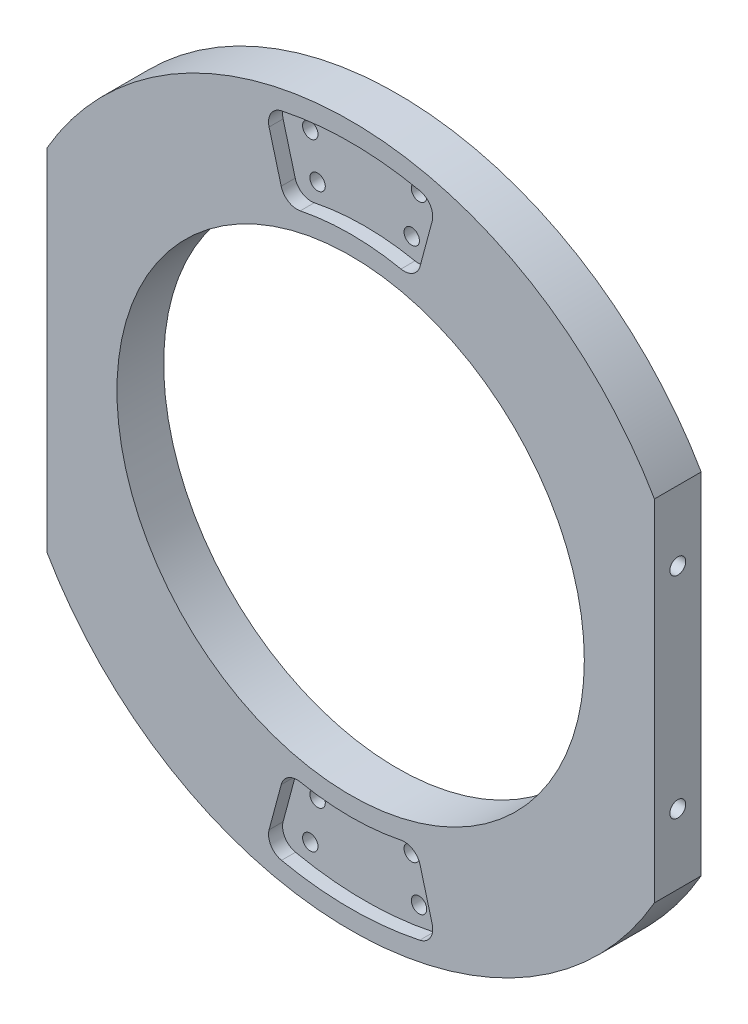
ISO-10303-21;
HEADER;
FILE_DESCRIPTION(('STEP AP214'),'2;1');
FILE_NAME('part.step','',(''),(''),'','','');
FILE_SCHEMA(('AUTOMOTIVE_DESIGN { 1 0 10303 214 1 1 1 1 }'));
ENDSEC;
DATA;
#1=APPLICATION_CONTEXT('core data for automotive mechanical design processes');
#2=APPLICATION_PROTOCOL_DEFINITION('international standard','automotive_design',2000,#1);
#3=PRODUCT_CONTEXT('',#1,'mechanical');
#4=PRODUCT('Part','Part','',(#3));
#5=PRODUCT_RELATED_PRODUCT_CATEGORY('part','',(#4));
#6=PRODUCT_DEFINITION_FORMATION('','',#4);
#7=PRODUCT_DEFINITION_CONTEXT('part definition',#1,'design');
#8=PRODUCT_DEFINITION('design','',#6,#7);
#9=PRODUCT_DEFINITION_SHAPE('','',#8);
#10=(LENGTH_UNIT() NAMED_UNIT(*) SI_UNIT(.MILLI.,.METRE.));
#11=(NAMED_UNIT(*) PLANE_ANGLE_UNIT() SI_UNIT($,.RADIAN.));
#12=(NAMED_UNIT(*) SI_UNIT($,.STERADIAN.) SOLID_ANGLE_UNIT());
#13=UNCERTAINTY_MEASURE_WITH_UNIT(LENGTH_MEASURE(1.E-05),#10,'distance_accuracy_value','');
#14=(GEOMETRIC_REPRESENTATION_CONTEXT(3) GLOBAL_UNCERTAINTY_ASSIGNED_CONTEXT((#13)) GLOBAL_UNIT_ASSIGNED_CONTEXT((#10,
#11,#12)) REPRESENTATION_CONTEXT('',''));
#15=CARTESIAN_POINT('',(0.,0.,0.));
#16=DIRECTION('',(0.,0.,1.));
#17=DIRECTION('',(1.,0.,0.));
#18=AXIS2_PLACEMENT_3D('',#15,#16,#17);
#19=CARTESIAN_POINT('',(0.,0.,-20.));
#20=DIRECTION('',(0.,0.,1.));
#21=DIRECTION('',(1.,0.,0.));
#22=AXIS2_PLACEMENT_3D('',#19,#20,#21);
#23=PLANE('',#22);
#24=CARTESIAN_POINT('',(0.,0.,-20.));
#25=DIRECTION('',(0.,0.,1.));
#26=DIRECTION('',(1.,0.,0.));
#27=AXIS2_PLACEMENT_3D('',#24,#25,#26);
#28=CIRCLE('',#27,100.);
#29=CARTESIAN_POINT('',(100.,0.,-20.));
#30=VERTEX_POINT('',#29);
#31=EDGE_CURVE('E455',#30,#30,#28,.T.);
#32=ORIENTED_EDGE('',*,*,#31,.T.);
#33=EDGE_LOOP('',(#32));
#34=FACE_BOUND('',#33,.T.);
#35=CARTESIAN_POINT('',(23.2688558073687,131.964238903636,-20.));
#36=DIRECTION('',(0.,0.,-1.));
#37=DIRECTION('',(-1.,0.,0.));
#38=AXIS2_PLACEMENT_3D('',#35,#36,#37);
#39=CIRCLE('',#38,6.);
#40=CARTESIAN_POINT('',(17.2688558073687,131.964238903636,-20.));
#41=VERTEX_POINT('',#40);
#42=EDGE_CURVE('E406',#41,#41,#39,.T.);
#43=ORIENTED_EDGE('',*,*,#42,.F.);
#44=EDGE_LOOP('',(#43));
#45=FACE_BOUND('',#44,.T.);
#46=CARTESIAN_POINT('',(-20.143188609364,114.237699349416,-20.));
#47=DIRECTION('',(0.,0.,-1.));
#48=DIRECTION('',(-1.,0.,0.));
#49=AXIS2_PLACEMENT_3D('',#46,#47,#48);
#50=CIRCLE('',#49,6.);
#51=CARTESIAN_POINT('',(-26.143188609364,114.237699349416,-20.));
#52=VERTEX_POINT('',#51);
#53=EDGE_CURVE('E389',#52,#52,#50,.T.);
#54=ORIENTED_EDGE('',*,*,#53,.F.);
#55=EDGE_LOOP('',(#54));
#56=FACE_BOUND('',#55,.T.);
#57=CARTESIAN_POINT('',(-23.2688558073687,131.964238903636,-20.));
#58=DIRECTION('',(0.,0.,-1.));
#59=DIRECTION('',(-1.,0.,0.));
#60=AXIS2_PLACEMENT_3D('',#57,#58,#59);
#61=CIRCLE('',#60,6.);
#62=CARTESIAN_POINT('',(-29.2688558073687,131.964238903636,-20.));
#63=VERTEX_POINT('',#62);
#64=EDGE_CURVE('E372',#63,#63,#61,.T.);
#65=ORIENTED_EDGE('',*,*,#64,.F.);
#66=EDGE_LOOP('',(#65));
#67=FACE_BOUND('',#66,.T.);
#68=CARTESIAN_POINT('',(20.143188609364,114.237699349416,-20.));
#69=DIRECTION('',(0.,0.,-1.));
#70=DIRECTION('',(-1.,0.,0.));
#71=AXIS2_PLACEMENT_3D('',#68,#69,#70);
#72=CIRCLE('',#71,6.);
#73=CARTESIAN_POINT('',(14.143188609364,114.237699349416,-20.));
#74=VERTEX_POINT('',#73);
#75=EDGE_CURVE('E344',#74,#74,#72,.T.);
#76=ORIENTED_EDGE('',*,*,#75,.F.);
#77=EDGE_LOOP('',(#76));
#78=FACE_BOUND('',#77,.T.);
#79=CARTESIAN_POINT('',(23.2688558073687,-131.964238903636,-20.));
#80=DIRECTION('',(0.,0.,-1.));
#81=DIRECTION('',(-1.,0.,0.));
#82=AXIS2_PLACEMENT_3D('',#79,#80,#81);
#83=CIRCLE('',#82,6.);
#84=CARTESIAN_POINT('',(17.2688558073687,-131.964238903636,-20.));
#85=VERTEX_POINT('',#84);
#86=EDGE_CURVE('E318',#85,#85,#83,.T.);
#87=ORIENTED_EDGE('',*,*,#86,.F.);
#88=EDGE_LOOP('',(#87));
#89=FACE_BOUND('',#88,.T.);
#90=CARTESIAN_POINT('',(-20.143188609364,-114.237699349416,-20.));
#91=DIRECTION('',(0.,0.,-1.));
#92=DIRECTION('',(-1.,0.,0.));
#93=AXIS2_PLACEMENT_3D('',#90,#91,#92);
#94=CIRCLE('',#93,6.);
#95=CARTESIAN_POINT('',(-26.143188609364,-114.237699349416,-20.));
#96=VERTEX_POINT('',#95);
#97=EDGE_CURVE('E305',#96,#96,#94,.T.);
#98=ORIENTED_EDGE('',*,*,#97,.F.);
#99=EDGE_LOOP('',(#98));
#100=FACE_BOUND('',#99,.T.);
#101=CARTESIAN_POINT('',(-23.2688558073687,-131.964238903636,-20.));
#102=DIRECTION('',(0.,0.,-1.));
#103=DIRECTION('',(-1.,0.,0.));
#104=AXIS2_PLACEMENT_3D('',#101,#102,#103);
#105=CIRCLE('',#104,6.);
#106=CARTESIAN_POINT('',(-29.2688558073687,-131.964238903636,-20.));
#107=VERTEX_POINT('',#106);
#108=EDGE_CURVE('E292',#107,#107,#105,.T.);
#109=ORIENTED_EDGE('',*,*,#108,.F.);
#110=EDGE_LOOP('',(#109));
#111=FACE_BOUND('',#110,.T.);
#112=CARTESIAN_POINT('',(20.143188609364,-114.237699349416,-20.));
#113=DIRECTION('',(0.,0.,-1.));
#114=DIRECTION('',(-1.,0.,0.));
#115=AXIS2_PLACEMENT_3D('',#112,#113,#114);
#116=CIRCLE('',#115,6.);
#117=CARTESIAN_POINT('',(14.143188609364,-114.237699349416,-20.));
#118=VERTEX_POINT('',#117);
#119=EDGE_CURVE('E276',#118,#118,#116,.T.);
#120=ORIENTED_EDGE('',*,*,#119,.F.);
#121=EDGE_LOOP('',(#120));
#122=FACE_BOUND('',#121,.T.);
#123=DIRECTION('',(0.,-1.,0.));
#124=VECTOR('',#123,1.);
#125=CARTESIAN_POINT('',(-130.,-150.,-20.));
#126=LINE('',#125,#124);
#127=CARTESIAN_POINT('',(-130.,74.8331477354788,-20.));
#128=VERTEX_POINT('',#127);
#129=CARTESIAN_POINT('',(-130.,-74.8331477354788,-20.));
#130=VERTEX_POINT('',#129);
#131=EDGE_CURVE('E269',#128,#130,#126,.T.);
#132=ORIENTED_EDGE('',*,*,#131,.F.);
#133=CARTESIAN_POINT('',(0.,0.,-20.));
#134=DIRECTION('',(0.,0.,1.));
#135=DIRECTION('',(1.,0.,0.));
#136=AXIS2_PLACEMENT_3D('',#133,#134,#135);
#137=CIRCLE('',#136,150.);
#138=CARTESIAN_POINT('',(130.,74.8331477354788,-20.));
#139=VERTEX_POINT('',#138);
#140=EDGE_CURVE('E462',#139,#128,#137,.T.);
#141=ORIENTED_EDGE('',*,*,#140,.F.);
#142=DIRECTION('',(0.,1.,0.));
#143=VECTOR('',#142,1.);
#144=CARTESIAN_POINT('',(130.,-150.,-20.));
#145=LINE('',#144,#143);
#146=CARTESIAN_POINT('',(130.,-74.8331477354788,-20.));
#147=VERTEX_POINT('',#146);
#148=EDGE_CURVE('E272',#147,#139,#145,.T.);
#149=ORIENTED_EDGE('',*,*,#148,.F.);
#150=EDGE_CURVE('E466',#130,#147,#137,.T.);
#151=ORIENTED_EDGE('',*,*,#150,.F.);
#152=EDGE_LOOP('',(#132,#141,#149,#151));
#153=FACE_BOUND('',#152,.T.);
#154=ADVANCED_FACE('F55',(#34,#45,#56,#67,#78,#89,#100,#111,#122,#153),#23,.F.);
#155=CARTESIAN_POINT('',(0.,0.,0.));
#156=DIRECTION('',(0.,0.,1.));
#157=DIRECTION('',(1.,0.,0.));
#158=AXIS2_PLACEMENT_3D('',#155,#156,#157);
#159=PLANE('',#158);
#160=CARTESIAN_POINT('',(0.,0.,0.));
#161=DIRECTION('',(0.,0.,1.));
#162=DIRECTION('',(1.,0.,0.));
#163=AXIS2_PLACEMENT_3D('',#160,#161,#162);
#164=CIRCLE('',#163,100.);
#165=CARTESIAN_POINT('',(100.,0.,0.));
#166=VERTEX_POINT('',#165);
#167=EDGE_CURVE('E439',#166,#166,#164,.T.);
#168=ORIENTED_EDGE('',*,*,#167,.F.);
#169=EDGE_LOOP('',(#168));
#170=FACE_BOUND('',#169,.T.);
#171=CARTESIAN_POINT('',(0.,0.,0.));
#172=DIRECTION('',(0.,0.,-1.));
#173=DIRECTION('',(1.,0.,0.));
#174=AXIS2_PLACEMENT_3D('',#171,#172,#173);
#175=CIRCLE('',#174,108.);
#176=CARTESIAN_POINT('',(-21.5507130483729,105.828005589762,0.));
#177=VERTEX_POINT('',#176);
#178=CARTESIAN_POINT('',(21.5507130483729,105.828005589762,0.));
#179=VERTEX_POINT('',#178);
#180=EDGE_CURVE('E440',#177,#179,#175,.T.);
#181=ORIENTED_EDGE('',*,*,#180,.F.);
#182=CARTESIAN_POINT('',(-22.9475185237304,112.687228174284,0.));
#183=DIRECTION('',(0.,0.,1.));
#184=DIRECTION('',(1.,0.,0.));
#185=AXIS2_PLACEMENT_3D('',#182,#183,#184);
#186=CIRCLE('',#185,7.);
#187=CARTESIAN_POINT('',(-29.7089993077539,110.875494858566,0.));
#188=VERTEX_POINT('',#187);
#189=EDGE_CURVE('E514',#177,#188,#186,.F.);
#190=ORIENTED_EDGE('',*,*,#189,.T.);
#191=DIRECTION('',(0.258819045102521,-0.965925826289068,0.));
#192=VECTOR('',#191,1.);
#193=CARTESIAN_POINT('',(-27.9524568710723,104.319989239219,0.));
#194=LINE('',#193,#192);
#195=CARTESIAN_POINT('',(-34.8935686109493,130.224570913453,0.));
#196=VERTEX_POINT('',#195);
#197=EDGE_CURVE('E427',#196,#188,#194,.T.);
#198=ORIENTED_EDGE('',*,*,#197,.F.);
#199=CARTESIAN_POINT('',(-28.1320878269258,132.036304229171,0.));
#200=DIRECTION('',(0.,0.,1.));
#201=DIRECTION('',(1.,0.,0.));
#202=AXIS2_PLACEMENT_3D('',#199,#200,#201);
#203=CIRCLE('',#202,7.);
#204=CARTESIAN_POINT('',(-29.5907886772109,138.882631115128,0.));
#205=VERTEX_POINT('',#204);
#206=EDGE_CURVE('E517',#196,#205,#203,.F.);
#207=ORIENTED_EDGE('',*,*,#206,.T.);
#208=CARTESIAN_POINT('',(0.,0.,0.));
#209=DIRECTION('',(0.,0.,1.));
#210=DIRECTION('',(1.,0.,0.));
#211=AXIS2_PLACEMENT_3D('',#208,#209,#210);
#212=CIRCLE('',#211,142.);
#213=CARTESIAN_POINT('',(29.5907886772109,138.882631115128,0.));
#214=VERTEX_POINT('',#213);
#215=EDGE_CURVE('E448',#214,#205,#212,.T.);
#216=ORIENTED_EDGE('',*,*,#215,.F.);
#217=CARTESIAN_POINT('',(28.1320878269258,132.036304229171,0.));
#218=DIRECTION('',(0.,0.,1.));
#219=DIRECTION('',(1.,0.,0.));
#220=AXIS2_PLACEMENT_3D('',#217,#218,#219);
#221=CIRCLE('',#220,7.);
#222=CARTESIAN_POINT('',(34.8935686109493,130.224570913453,0.));
#223=VERTEX_POINT('',#222);
#224=EDGE_CURVE('E511',#214,#223,#221,.F.);
#225=ORIENTED_EDGE('',*,*,#224,.T.);
#226=DIRECTION('',(0.258819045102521,0.965925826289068,0.));
#227=VECTOR('',#226,1.);
#228=CARTESIAN_POINT('',(27.9524568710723,104.319989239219,0.));
#229=LINE('',#228,#227);
#230=CARTESIAN_POINT('',(29.7089993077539,110.875494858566,0.));
#231=VERTEX_POINT('',#230);
#232=EDGE_CURVE('E444',#231,#223,#229,.T.);
#233=ORIENTED_EDGE('',*,*,#232,.F.);
#234=CARTESIAN_POINT('',(22.9475185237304,112.687228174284,0.));
#235=DIRECTION('',(0.,0.,1.));
#236=DIRECTION('',(1.,0.,0.));
#237=AXIS2_PLACEMENT_3D('',#234,#235,#236);
#238=CIRCLE('',#237,7.);
#239=EDGE_CURVE('E508',#231,#179,#238,.F.);
#240=ORIENTED_EDGE('',*,*,#239,.T.);
#241=EDGE_LOOP('',(#181,#190,#198,#207,#216,#225,#233,#240));
#242=FACE_BOUND('',#241,.T.);
#243=CARTESIAN_POINT('',(0.,0.,0.));
#244=DIRECTION('',(0.,0.,-1.));
#245=DIRECTION('',(1.,0.,0.));
#246=AXIS2_PLACEMENT_3D('',#243,#244,#245);
#247=CIRCLE('',#246,142.);
#248=CARTESIAN_POINT('',(29.5907886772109,-138.882631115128,0.));
#249=VERTEX_POINT('',#248);
#250=CARTESIAN_POINT('',(-29.5907886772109,-138.882631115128,0.));
#251=VERTEX_POINT('',#250);
#252=EDGE_CURVE('E351',#249,#251,#247,.T.);
#253=ORIENTED_EDGE('',*,*,#252,.T.);
#254=CARTESIAN_POINT('',(-28.1320878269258,-132.036304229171,0.));
#255=DIRECTION('',(0.,0.,1.));
#256=DIRECTION('',(1.,0.,0.));
#257=AXIS2_PLACEMENT_3D('',#254,#255,#256);
#258=CIRCLE('',#257,7.);
#259=CARTESIAN_POINT('',(-34.8935686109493,-130.224570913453,0.));
#260=VERTEX_POINT('',#259);
#261=EDGE_CURVE('E566',#251,#260,#258,.F.);
#262=ORIENTED_EDGE('',*,*,#261,.T.);
#263=DIRECTION('',(0.258819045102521,0.965925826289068,0.));
#264=VECTOR('',#263,1.);
#265=CARTESIAN_POINT('',(-27.9524568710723,-104.319989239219,0.));
#266=LINE('',#265,#264);
#267=CARTESIAN_POINT('',(-29.7089993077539,-110.875494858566,0.));
#268=VERTEX_POINT('',#267);
#269=EDGE_CURVE('E348',#260,#268,#266,.T.);
#270=ORIENTED_EDGE('',*,*,#269,.T.);
#271=CARTESIAN_POINT('',(-22.9475185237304,-112.687228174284,0.));
#272=DIRECTION('',(0.,0.,1.));
#273=DIRECTION('',(1.,0.,0.));
#274=AXIS2_PLACEMENT_3D('',#271,#272,#273);
#275=CIRCLE('',#274,7.);
#276=CARTESIAN_POINT('',(-21.5507130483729,-105.828005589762,0.));
#277=VERTEX_POINT('',#276);
#278=EDGE_CURVE('E564',#268,#277,#275,.F.);
#279=ORIENTED_EDGE('',*,*,#278,.T.);
#280=CARTESIAN_POINT('',(0.,0.,0.));
#281=DIRECTION('',(0.,0.,1.));
#282=DIRECTION('',(1.,0.,0.));
#283=AXIS2_PLACEMENT_3D('',#280,#281,#282);
#284=CIRCLE('',#283,108.);
#285=CARTESIAN_POINT('',(21.5507130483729,-105.828005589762,0.));
#286=VERTEX_POINT('',#285);
#287=EDGE_CURVE('E345',#277,#286,#284,.T.);
#288=ORIENTED_EDGE('',*,*,#287,.T.);
#289=CARTESIAN_POINT('',(22.9475185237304,-112.687228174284,0.));
#290=DIRECTION('',(0.,0.,1.));
#291=DIRECTION('',(1.,0.,0.));
#292=AXIS2_PLACEMENT_3D('',#289,#290,#291);
#293=CIRCLE('',#292,7.);
#294=CARTESIAN_POINT('',(29.7089993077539,-110.875494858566,0.));
#295=VERTEX_POINT('',#294);
#296=EDGE_CURVE('E560',#286,#295,#293,.F.);
#297=ORIENTED_EDGE('',*,*,#296,.T.);
#298=DIRECTION('',(0.258819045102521,-0.965925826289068,0.));
#299=VECTOR('',#298,1.);
#300=CARTESIAN_POINT('',(27.9524568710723,-104.319989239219,0.));
#301=LINE('',#300,#299);
#302=CARTESIAN_POINT('',(34.8935686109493,-130.224570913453,0.));
#303=VERTEX_POINT('',#302);
#304=EDGE_CURVE('E335',#295,#303,#301,.T.);
#305=ORIENTED_EDGE('',*,*,#304,.T.);
#306=CARTESIAN_POINT('',(28.1320878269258,-132.036304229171,0.));
#307=DIRECTION('',(0.,0.,1.));
#308=DIRECTION('',(1.,0.,0.));
#309=AXIS2_PLACEMENT_3D('',#306,#307,#308);
#310=CIRCLE('',#309,7.);
#311=EDGE_CURVE('E562',#303,#249,#310,.F.);
#312=ORIENTED_EDGE('',*,*,#311,.T.);
#313=EDGE_LOOP('',(#253,#262,#270,#279,#288,#297,#305,#312));
#314=FACE_BOUND('',#313,.T.);
#315=CARTESIAN_POINT('',(0.,0.,0.));
#316=DIRECTION('',(0.,0.,1.));
#317=DIRECTION('',(1.,0.,0.));
#318=AXIS2_PLACEMENT_3D('',#315,#316,#317);
#319=CIRCLE('',#318,150.);
#320=CARTESIAN_POINT('',(130.,74.8331477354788,0.));
#321=VERTEX_POINT('',#320);
#322=CARTESIAN_POINT('',(-130.,74.8331477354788,0.));
#323=VERTEX_POINT('',#322);
#324=EDGE_CURVE('E75',#321,#323,#319,.T.);
#325=ORIENTED_EDGE('',*,*,#324,.T.);
#326=DIRECTION('',(0.,-1.,0.));
#327=VECTOR('',#326,1.);
#328=CARTESIAN_POINT('',(-130.,-150.,0.));
#329=LINE('',#328,#327);
#330=CARTESIAN_POINT('',(-130.,-74.8331477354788,0.));
#331=VERTEX_POINT('',#330);
#332=EDGE_CURVE('E268',#323,#331,#329,.T.);
#333=ORIENTED_EDGE('',*,*,#332,.T.);
#334=CARTESIAN_POINT('',(130.,-74.8331477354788,0.));
#335=VERTEX_POINT('',#334);
#336=EDGE_CURVE('E70',#331,#335,#319,.T.);
#337=ORIENTED_EDGE('',*,*,#336,.T.);
#338=DIRECTION('',(0.,1.,0.));
#339=VECTOR('',#338,1.);
#340=CARTESIAN_POINT('',(130.,-150.,0.));
#341=LINE('',#340,#339);
#342=EDGE_CURVE('E273',#335,#321,#341,.T.);
#343=ORIENTED_EDGE('',*,*,#342,.T.);
#344=EDGE_LOOP('',(#325,#333,#337,#343));
#345=FACE_BOUND('',#344,.T.);
#346=ADVANCED_FACE('F600',(#170,#242,#314,#345),#159,.T.);
#347=CARTESIAN_POINT('',(0.,0.,-20.));
#348=DIRECTION('',(0.,0.,1.));
#349=DIRECTION('',(1.,0.,0.));
#350=AXIS2_PLACEMENT_3D('',#347,#348,#349);
#351=CYLINDRICAL_SURFACE('',#350,150.);
#352=ORIENTED_EDGE('',*,*,#140,.T.);
#353=DIRECTION('',(0.,0.,1.));
#354=VECTOR('',#353,1.);
#355=CARTESIAN_POINT('',(-130.,74.8331477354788,-20.));
#356=LINE('',#355,#354);
#357=EDGE_CURVE('E63',#128,#323,#356,.T.);
#358=ORIENTED_EDGE('',*,*,#357,.T.);
#359=ORIENTED_EDGE('',*,*,#324,.F.);
#360=DIRECTION('',(0.,0.,1.));
#361=VECTOR('',#360,1.);
#362=CARTESIAN_POINT('',(130.,74.8331477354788,-20.));
#363=LINE('',#362,#361);
#364=EDGE_CURVE('E580',#321,#139,#363,.F.);
#365=ORIENTED_EDGE('',*,*,#364,.T.);
#366=EDGE_LOOP('',(#352,#358,#359,#365));
#367=FACE_BOUND('',#366,.T.);
#368=ADVANCED_FACE('F586',(#367),#351,.T.);
#369=ORIENTED_EDGE('',*,*,#150,.T.);
#370=DIRECTION('',(0.,0.,1.));
#371=VECTOR('',#370,1.);
#372=CARTESIAN_POINT('',(130.,-74.8331477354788,-20.));
#373=LINE('',#372,#371);
#374=EDGE_CURVE('E568',#147,#335,#373,.T.);
#375=ORIENTED_EDGE('',*,*,#374,.T.);
#376=ORIENTED_EDGE('',*,*,#336,.F.);
#377=DIRECTION('',(0.,0.,1.));
#378=VECTOR('',#377,1.);
#379=CARTESIAN_POINT('',(-130.,-74.8331477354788,-20.));
#380=LINE('',#379,#378);
#381=EDGE_CURVE('E14',#331,#130,#380,.F.);
#382=ORIENTED_EDGE('',*,*,#381,.T.);
#383=EDGE_LOOP('',(#369,#375,#376,#382));
#384=FACE_BOUND('',#383,.T.);
#385=ADVANCED_FACE('F597',(#384),#351,.T.);
#386=CARTESIAN_POINT('',(0.,0.,-20.));
#387=DIRECTION('',(0.,0.,1.));
#388=DIRECTION('',(1.,0.,0.));
#389=AXIS2_PLACEMENT_3D('',#386,#387,#388);
#390=CYLINDRICAL_SURFACE('',#389,100.);
#391=ORIENTED_EDGE('',*,*,#31,.F.);
#392=EDGE_LOOP('',(#391));
#393=FACE_BOUND('',#392,.T.);
#394=ORIENTED_EDGE('',*,*,#167,.T.);
#395=EDGE_LOOP('',(#394));
#396=FACE_BOUND('',#395,.T.);
#397=ADVANCED_FACE('F768',(#393,#396),#390,.F.);
#398=CARTESIAN_POINT('',(0.,0.,-6.));
#399=DIRECTION('',(0.,0.,1.));
#400=DIRECTION('',(1.,0.,0.));
#401=AXIS2_PLACEMENT_3D('',#398,#399,#400);
#402=CYLINDRICAL_SURFACE('',#401,108.);
#403=ORIENTED_EDGE('',*,*,#180,.T.);
#404=DIRECTION('',(0.,0.,1.));
#405=VECTOR('',#404,1.);
#406=CARTESIAN_POINT('',(21.5507130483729,105.828005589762,-6.));
#407=LINE('',#406,#405);
#408=CARTESIAN_POINT('',(21.5507130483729,105.828005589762,-6.));
#409=VERTEX_POINT('',#408);
#410=EDGE_CURVE('E479',#179,#409,#407,.F.);
#411=ORIENTED_EDGE('',*,*,#410,.T.);
#412=CARTESIAN_POINT('',(0.,0.,-6.));
#413=DIRECTION('',(0.,0.,-1.));
#414=DIRECTION('',(1.,0.,0.));
#415=AXIS2_PLACEMENT_3D('',#412,#413,#414);
#416=CIRCLE('',#415,108.);
#417=CARTESIAN_POINT('',(-21.5507130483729,105.828005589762,-6.));
#418=VERTEX_POINT('',#417);
#419=EDGE_CURVE('E423',#418,#409,#416,.T.);
#420=ORIENTED_EDGE('',*,*,#419,.F.);
#421=DIRECTION('',(0.,0.,1.));
#422=VECTOR('',#421,1.);
#423=CARTESIAN_POINT('',(-21.5507130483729,105.828005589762,-6.));
#424=LINE('',#423,#422);
#425=EDGE_CURVE('E475',#418,#177,#424,.T.);
#426=ORIENTED_EDGE('',*,*,#425,.T.);
#427=EDGE_LOOP('',(#403,#411,#420,#426));
#428=FACE_BOUND('',#427,.T.);
#429=ADVANCED_FACE('F759',(#428),#402,.T.);
#430=CARTESIAN_POINT('',(-27.9524568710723,104.319989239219,-6.));
#431=DIRECTION('',(-0.965925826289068,-0.258819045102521,0.));
#432=DIRECTION('',(0.258819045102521,-0.965925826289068,0.));
#433=AXIS2_PLACEMENT_3D('',#430,#431,#432);
#434=PLANE('',#433);
#435=ORIENTED_EDGE('',*,*,#197,.T.);
#436=DIRECTION('',(0.,0.,-1.));
#437=VECTOR('',#436,1.);
#438=CARTESIAN_POINT('',(-29.7089993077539,110.875494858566,-6.));
#439=LINE('',#438,#437);
#440=CARTESIAN_POINT('',(-29.7089993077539,110.875494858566,-6.));
#441=VERTEX_POINT('',#440);
#442=EDGE_CURVE('E505',#188,#441,#439,.T.);
#443=ORIENTED_EDGE('',*,*,#442,.T.);
#444=DIRECTION('',(0.258819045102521,-0.965925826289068,0.));
#445=VECTOR('',#444,1.);
#446=CARTESIAN_POINT('',(-27.9524568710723,104.319989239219,-6.));
#447=LINE('',#446,#445);
#448=CARTESIAN_POINT('',(-34.8935686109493,130.224570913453,-6.));
#449=VERTEX_POINT('',#448);
#450=EDGE_CURVE('E435',#449,#441,#447,.T.);
#451=ORIENTED_EDGE('',*,*,#450,.F.);
#452=DIRECTION('',(0.,0.,-1.));
#453=VECTOR('',#452,1.);
#454=CARTESIAN_POINT('',(-34.8935686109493,130.224570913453,0.));
#455=LINE('',#454,#453);
#456=EDGE_CURVE('E501',#449,#196,#455,.F.);
#457=ORIENTED_EDGE('',*,*,#456,.T.);
#458=EDGE_LOOP('',(#435,#443,#451,#457));
#459=FACE_BOUND('',#458,.T.);
#460=ADVANCED_FACE('F755',(#459),#434,.F.);
#461=CARTESIAN_POINT('',(0.,0.,-6.));
#462=DIRECTION('',(0.,0.,1.));
#463=DIRECTION('',(1.,0.,0.));
#464=AXIS2_PLACEMENT_3D('',#461,#462,#463);
#465=CYLINDRICAL_SURFACE('',#464,142.);
#466=CARTESIAN_POINT('',(0.,0.,-6.));
#467=DIRECTION('',(0.,0.,1.));
#468=DIRECTION('',(1.,0.,0.));
#469=AXIS2_PLACEMENT_3D('',#466,#467,#468);
#470=CIRCLE('',#469,142.);
#471=CARTESIAN_POINT('',(29.5907886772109,138.882631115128,-6.));
#472=VERTEX_POINT('',#471);
#473=CARTESIAN_POINT('',(-29.5907886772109,138.882631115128,-6.));
#474=VERTEX_POINT('',#473);
#475=EDGE_CURVE('E431',#472,#474,#470,.T.);
#476=ORIENTED_EDGE('',*,*,#475,.F.);
#477=DIRECTION('',(0.,0.,1.));
#478=VECTOR('',#477,1.);
#479=CARTESIAN_POINT('',(29.5907886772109,138.882631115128,-6.));
#480=LINE('',#479,#478);
#481=EDGE_CURVE('E497',#472,#214,#480,.T.);
#482=ORIENTED_EDGE('',*,*,#481,.T.);
#483=ORIENTED_EDGE('',*,*,#215,.T.);
#484=DIRECTION('',(0.,0.,1.));
#485=VECTOR('',#484,1.);
#486=CARTESIAN_POINT('',(-29.5907886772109,138.882631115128,-6.));
#487=LINE('',#486,#485);
#488=EDGE_CURVE('E494',#205,#474,#487,.F.);
#489=ORIENTED_EDGE('',*,*,#488,.T.);
#490=EDGE_LOOP('',(#476,#482,#483,#489));
#491=FACE_BOUND('',#490,.T.);
#492=ADVANCED_FACE('F758',(#491),#465,.F.);
#493=CARTESIAN_POINT('',(27.9524568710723,104.319989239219,-6.));
#494=DIRECTION('',(0.965925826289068,-0.258819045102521,0.));
#495=DIRECTION('',(0.258819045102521,0.965925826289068,0.));
#496=AXIS2_PLACEMENT_3D('',#493,#494,#495);
#497=PLANE('',#496);
#498=DIRECTION('',(0.258819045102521,0.965925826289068,0.));
#499=VECTOR('',#498,1.);
#500=CARTESIAN_POINT('',(27.9524568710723,104.319989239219,-6.));
#501=LINE('',#500,#499);
#502=CARTESIAN_POINT('',(29.7089993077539,110.875494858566,-6.));
#503=VERTEX_POINT('',#502);
#504=CARTESIAN_POINT('',(34.8935686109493,130.224570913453,-6.));
#505=VERTEX_POINT('',#504);
#506=EDGE_CURVE('E426',#503,#505,#501,.T.);
#507=ORIENTED_EDGE('',*,*,#506,.F.);
#508=DIRECTION('',(0.,0.,-1.));
#509=VECTOR('',#508,1.);
#510=CARTESIAN_POINT('',(29.7089993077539,110.875494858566,0.));
#511=LINE('',#510,#509);
#512=EDGE_CURVE('E471',#503,#231,#511,.F.);
#513=ORIENTED_EDGE('',*,*,#512,.T.);
#514=ORIENTED_EDGE('',*,*,#232,.T.);
#515=DIRECTION('',(0.,0.,-1.));
#516=VECTOR('',#515,1.);
#517=CARTESIAN_POINT('',(34.8935686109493,130.224570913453,-6.));
#518=LINE('',#517,#516);
#519=EDGE_CURVE('E465',#223,#505,#518,.T.);
#520=ORIENTED_EDGE('',*,*,#519,.T.);
#521=EDGE_LOOP('',(#507,#513,#514,#520));
#522=FACE_BOUND('',#521,.T.);
#523=ADVANCED_FACE('F753',(#522),#497,.F.);
#524=CARTESIAN_POINT('',(0.,0.,-6.));
#525=DIRECTION('',(0.,0.,1.));
#526=DIRECTION('',(1.,0.,0.));
#527=AXIS2_PLACEMENT_3D('',#524,#525,#526);
#528=PLANE('',#527);
#529=CARTESIAN_POINT('',(20.143188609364,114.237699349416,-6.));
#530=DIRECTION('',(0.,0.,1.));
#531=DIRECTION('',(1.,0.,0.));
#532=AXIS2_PLACEMENT_3D('',#529,#530,#531);
#533=CIRCLE('',#532,3.3);
#534=CARTESIAN_POINT('',(23.443188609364,114.237699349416,-6.));
#535=VERTEX_POINT('',#534);
#536=EDGE_CURVE('E371',#535,#535,#533,.T.);
#537=ORIENTED_EDGE('',*,*,#536,.F.);
#538=EDGE_LOOP('',(#537));
#539=FACE_BOUND('',#538,.T.);
#540=CARTESIAN_POINT('',(-23.2688558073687,131.964238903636,-6.));
#541=DIRECTION('',(0.,0.,1.));
#542=DIRECTION('',(1.,0.,0.));
#543=AXIS2_PLACEMENT_3D('',#540,#541,#542);
#544=CIRCLE('',#543,3.3);
#545=CARTESIAN_POINT('',(-19.9688558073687,131.964238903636,-6.));
#546=VERTEX_POINT('',#545);
#547=EDGE_CURVE('E388',#546,#546,#544,.T.);
#548=ORIENTED_EDGE('',*,*,#547,.F.);
#549=EDGE_LOOP('',(#548));
#550=FACE_BOUND('',#549,.T.);
#551=CARTESIAN_POINT('',(-20.143188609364,114.237699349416,-6.));
#552=DIRECTION('',(0.,0.,1.));
#553=DIRECTION('',(1.,0.,0.));
#554=AXIS2_PLACEMENT_3D('',#551,#552,#553);
#555=CIRCLE('',#554,3.3);
#556=CARTESIAN_POINT('',(-16.843188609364,114.237699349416,-6.));
#557=VERTEX_POINT('',#556);
#558=EDGE_CURVE('E405',#557,#557,#555,.T.);
#559=ORIENTED_EDGE('',*,*,#558,.F.);
#560=EDGE_LOOP('',(#559));
#561=FACE_BOUND('',#560,.T.);
#562=CARTESIAN_POINT('',(23.2688558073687,131.964238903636,-6.));
#563=DIRECTION('',(0.,0.,1.));
#564=DIRECTION('',(1.,0.,0.));
#565=AXIS2_PLACEMENT_3D('',#562,#563,#564);
#566=CIRCLE('',#565,3.3);
#567=CARTESIAN_POINT('',(26.5688558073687,131.964238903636,-6.));
#568=VERTEX_POINT('',#567);
#569=EDGE_CURVE('E422',#568,#568,#566,.T.);
#570=ORIENTED_EDGE('',*,*,#569,.F.);
#571=EDGE_LOOP('',(#570));
#572=FACE_BOUND('',#571,.T.);
#573=ORIENTED_EDGE('',*,*,#419,.T.);
#574=CARTESIAN_POINT('',(22.9475185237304,112.687228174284,-6.));
#575=DIRECTION('',(0.,0.,1.));
#576=DIRECTION('',(1.,0.,0.));
#577=AXIS2_PLACEMENT_3D('',#574,#575,#576);
#578=CIRCLE('',#577,7.);
#579=EDGE_CURVE('E491',#409,#503,#578,.T.);
#580=ORIENTED_EDGE('',*,*,#579,.T.);
#581=ORIENTED_EDGE('',*,*,#506,.T.);
#582=CARTESIAN_POINT('',(28.1320878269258,132.036304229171,-6.));
#583=DIRECTION('',(0.,0.,1.));
#584=DIRECTION('',(1.,0.,0.));
#585=AXIS2_PLACEMENT_3D('',#582,#583,#584);
#586=CIRCLE('',#585,7.);
#587=EDGE_CURVE('E488',#505,#472,#586,.T.);
#588=ORIENTED_EDGE('',*,*,#587,.T.);
#589=ORIENTED_EDGE('',*,*,#475,.T.);
#590=CARTESIAN_POINT('',(-28.1320878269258,132.036304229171,-6.));
#591=DIRECTION('',(0.,0.,1.));
#592=DIRECTION('',(1.,0.,0.));
#593=AXIS2_PLACEMENT_3D('',#590,#591,#592);
#594=CIRCLE('',#593,7.);
#595=EDGE_CURVE('E482',#474,#449,#594,.T.);
#596=ORIENTED_EDGE('',*,*,#595,.T.);
#597=ORIENTED_EDGE('',*,*,#450,.T.);
#598=CARTESIAN_POINT('',(-22.9475185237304,112.687228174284,-6.));
#599=DIRECTION('',(0.,0.,1.));
#600=DIRECTION('',(1.,0.,0.));
#601=AXIS2_PLACEMENT_3D('',#598,#599,#600);
#602=CIRCLE('',#601,7.);
#603=EDGE_CURVE('E485',#441,#418,#602,.T.);
#604=ORIENTED_EDGE('',*,*,#603,.T.);
#605=EDGE_LOOP('',(#573,#580,#581,#588,#589,#596,#597,#604));
#606=FACE_BOUND('',#605,.T.);
#607=ADVANCED_FACE('F619',(#539,#550,#561,#572,#606),#528,.T.);
#608=CARTESIAN_POINT('',(22.9475185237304,112.687228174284,-6.));
#609=DIRECTION('',(0.,0.,1.));
#610=DIRECTION('',(1.,0.,0.));
#611=AXIS2_PLACEMENT_3D('',#608,#609,#610);
#612=CYLINDRICAL_SURFACE('',#611,7.);
#613=ORIENTED_EDGE('',*,*,#579,.F.);
#614=ORIENTED_EDGE('',*,*,#410,.F.);
#615=ORIENTED_EDGE('',*,*,#239,.F.);
#616=ORIENTED_EDGE('',*,*,#512,.F.);
#617=EDGE_LOOP('',(#613,#614,#615,#616));
#618=FACE_BOUND('',#617,.T.);
#619=ADVANCED_FACE('F615',(#618),#612,.F.);
#620=CARTESIAN_POINT('',(28.1320878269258,132.036304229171,-6.));
#621=DIRECTION('',(0.,0.,1.));
#622=DIRECTION('',(1.,0.,0.));
#623=AXIS2_PLACEMENT_3D('',#620,#621,#622);
#624=CYLINDRICAL_SURFACE('',#623,7.);
#625=ORIENTED_EDGE('',*,*,#587,.F.);
#626=ORIENTED_EDGE('',*,*,#519,.F.);
#627=ORIENTED_EDGE('',*,*,#224,.F.);
#628=ORIENTED_EDGE('',*,*,#481,.F.);
#629=EDGE_LOOP('',(#625,#626,#627,#628));
#630=FACE_BOUND('',#629,.T.);
#631=ADVANCED_FACE('F618',(#630),#624,.F.);
#632=CARTESIAN_POINT('',(-22.9475185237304,112.687228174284,-6.));
#633=DIRECTION('',(0.,0.,1.));
#634=DIRECTION('',(1.,0.,0.));
#635=AXIS2_PLACEMENT_3D('',#632,#633,#634);
#636=CYLINDRICAL_SURFACE('',#635,7.);
#637=ORIENTED_EDGE('',*,*,#603,.F.);
#638=ORIENTED_EDGE('',*,*,#442,.F.);
#639=ORIENTED_EDGE('',*,*,#189,.F.);
#640=ORIENTED_EDGE('',*,*,#425,.F.);
#641=EDGE_LOOP('',(#637,#638,#639,#640));
#642=FACE_BOUND('',#641,.T.);
#643=ADVANCED_FACE('F623',(#642),#636,.F.);
#644=CARTESIAN_POINT('',(-28.1320878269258,132.036304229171,-6.));
#645=DIRECTION('',(0.,0.,1.));
#646=DIRECTION('',(1.,0.,0.));
#647=AXIS2_PLACEMENT_3D('',#644,#645,#646);
#648=CYLINDRICAL_SURFACE('',#647,7.);
#649=ORIENTED_EDGE('',*,*,#595,.F.);
#650=ORIENTED_EDGE('',*,*,#488,.F.);
#651=ORIENTED_EDGE('',*,*,#206,.F.);
#652=ORIENTED_EDGE('',*,*,#456,.F.);
#653=EDGE_LOOP('',(#649,#650,#651,#652));
#654=FACE_BOUND('',#653,.T.);
#655=ADVANCED_FACE('F627',(#654),#648,.F.);
#656=CARTESIAN_POINT('',(23.2688558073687,131.964238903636,-20.));
#657=DIRECTION('',(0.,0.,-1.));
#658=DIRECTION('',(-1.,0.,0.));
#659=AXIS2_PLACEMENT_3D('',#656,#657,#658);
#660=CYLINDRICAL_SURFACE('',#659,3.3);
#661=ORIENTED_EDGE('',*,*,#569,.T.);
#662=EDGE_LOOP('',(#661));
#663=FACE_BOUND('',#662,.T.);
#664=CARTESIAN_POINT('',(23.2688558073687,131.964238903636,-13.6));
#665=DIRECTION('',(0.,0.,-1.));
#666=DIRECTION('',(-1.,0.,0.));
#667=AXIS2_PLACEMENT_3D('',#664,#665,#666);
#668=CIRCLE('',#667,3.3);
#669=CARTESIAN_POINT('',(19.9688558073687,131.964238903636,-13.6));
#670=VERTEX_POINT('',#669);
#671=EDGE_CURVE('E418',#670,#670,#668,.T.);
#672=ORIENTED_EDGE('',*,*,#671,.T.);
#673=EDGE_LOOP('',(#672));
#674=FACE_BOUND('',#673,.T.);
#675=ADVANCED_FACE('F631',(#663,#674),#660,.F.);
#676=CARTESIAN_POINT('',(28.7688558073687,131.964238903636,-13.6));
#677=DIRECTION('',(0.,0.,1.));
#678=DIRECTION('',(1.,0.,0.));
#679=AXIS2_PLACEMENT_3D('',#676,#677,#678);
#680=PLANE('',#679);
#681=ORIENTED_EDGE('',*,*,#671,.F.);
#682=EDGE_LOOP('',(#681));
#683=FACE_BOUND('',#682,.T.);
#684=CARTESIAN_POINT('',(23.2688558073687,131.964238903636,-13.6));
#685=DIRECTION('',(0.,0.,-1.));
#686=DIRECTION('',(-1.,0.,0.));
#687=AXIS2_PLACEMENT_3D('',#684,#685,#686);
#688=CIRCLE('',#687,5.5);
#689=CARTESIAN_POINT('',(17.7688558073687,131.964238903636,-13.6));
#690=VERTEX_POINT('',#689);
#691=EDGE_CURVE('E414',#690,#690,#688,.T.);
#692=ORIENTED_EDGE('',*,*,#691,.T.);
#693=EDGE_LOOP('',(#692));
#694=FACE_BOUND('',#693,.T.);
#695=ADVANCED_FACE('F743',(#683,#694),#680,.F.);
#696=CARTESIAN_POINT('',(23.2688558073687,131.964238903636,-20.));
#697=DIRECTION('',(0.,0.,-1.));
#698=DIRECTION('',(-1.,0.,0.));
#699=AXIS2_PLACEMENT_3D('',#696,#697,#698);
#700=CYLINDRICAL_SURFACE('',#699,5.5);
#701=ORIENTED_EDGE('',*,*,#691,.F.);
#702=EDGE_LOOP('',(#701));
#703=FACE_BOUND('',#702,.T.);
#704=CARTESIAN_POINT('',(23.2688558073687,131.964238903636,-19.5));
#705=DIRECTION('',(0.,0.,-1.));
#706=DIRECTION('',(-1.,0.,0.));
#707=AXIS2_PLACEMENT_3D('',#704,#705,#706);
#708=CIRCLE('',#707,5.5);
#709=CARTESIAN_POINT('',(17.7688558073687,131.964238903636,-19.5));
#710=VERTEX_POINT('',#709);
#711=EDGE_CURVE('E410',#710,#710,#708,.T.);
#712=ORIENTED_EDGE('',*,*,#711,.T.);
#713=EDGE_LOOP('',(#712));
#714=FACE_BOUND('',#713,.T.);
#715=ADVANCED_FACE('F739',(#703,#714),#700,.F.);
#716=CARTESIAN_POINT('',(23.2688558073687,131.964238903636,-20.));
#717=DIRECTION('',(0.,0.,-1.));
#718=DIRECTION('',(-1.,0.,0.));
#719=AXIS2_PLACEMENT_3D('',#716,#717,#718);
#720=CONICAL_SURFACE('',#719,6.,0.785398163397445);
#721=ORIENTED_EDGE('',*,*,#711,.F.);
#722=EDGE_LOOP('',(#721));
#723=FACE_BOUND('',#722,.T.);
#724=ORIENTED_EDGE('',*,*,#42,.T.);
#725=EDGE_LOOP('',(#724));
#726=FACE_BOUND('',#725,.T.);
#727=ADVANCED_FACE('F735',(#723,#726),#720,.F.);
#728=CARTESIAN_POINT('',(-20.143188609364,114.237699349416,-20.));
#729=DIRECTION('',(0.,0.,-1.));
#730=DIRECTION('',(-1.,0.,0.));
#731=AXIS2_PLACEMENT_3D('',#728,#729,#730);
#732=CYLINDRICAL_SURFACE('',#731,3.3);
#733=ORIENTED_EDGE('',*,*,#558,.T.);
#734=EDGE_LOOP('',(#733));
#735=FACE_BOUND('',#734,.T.);
#736=CARTESIAN_POINT('',(-20.143188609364,114.237699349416,-13.6));
#737=DIRECTION('',(0.,0.,-1.));
#738=DIRECTION('',(-1.,0.,0.));
#739=AXIS2_PLACEMENT_3D('',#736,#737,#738);
#740=CIRCLE('',#739,3.3);
#741=CARTESIAN_POINT('',(-23.443188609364,114.237699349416,-13.6));
#742=VERTEX_POINT('',#741);
#743=EDGE_CURVE('E401',#742,#742,#740,.T.);
#744=ORIENTED_EDGE('',*,*,#743,.T.);
#745=EDGE_LOOP('',(#744));
#746=FACE_BOUND('',#745,.T.);
#747=ADVANCED_FACE('F731',(#735,#746),#732,.F.);
#748=CARTESIAN_POINT('',(-14.643188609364,114.237699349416,-13.6));
#749=DIRECTION('',(0.,0.,1.));
#750=DIRECTION('',(1.,0.,0.));
#751=AXIS2_PLACEMENT_3D('',#748,#749,#750);
#752=PLANE('',#751);
#753=ORIENTED_EDGE('',*,*,#743,.F.);
#754=EDGE_LOOP('',(#753));
#755=FACE_BOUND('',#754,.T.);
#756=CARTESIAN_POINT('',(-20.143188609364,114.237699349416,-13.6));
#757=DIRECTION('',(0.,0.,-1.));
#758=DIRECTION('',(-1.,0.,0.));
#759=AXIS2_PLACEMENT_3D('',#756,#757,#758);
#760=CIRCLE('',#759,5.5);
#761=CARTESIAN_POINT('',(-25.643188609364,114.237699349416,-13.6));
#762=VERTEX_POINT('',#761);
#763=EDGE_CURVE('E397',#762,#762,#760,.T.);
#764=ORIENTED_EDGE('',*,*,#763,.T.);
#765=EDGE_LOOP('',(#764));
#766=FACE_BOUND('',#765,.T.);
#767=ADVANCED_FACE('F727',(#755,#766),#752,.F.);
#768=CARTESIAN_POINT('',(-20.143188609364,114.237699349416,-20.));
#769=DIRECTION('',(0.,0.,-1.));
#770=DIRECTION('',(-1.,0.,0.));
#771=AXIS2_PLACEMENT_3D('',#768,#769,#770);
#772=CYLINDRICAL_SURFACE('',#771,5.5);
#773=ORIENTED_EDGE('',*,*,#763,.F.);
#774=EDGE_LOOP('',(#773));
#775=FACE_BOUND('',#774,.T.);
#776=CARTESIAN_POINT('',(-20.143188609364,114.237699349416,-19.5));
#777=DIRECTION('',(0.,0.,-1.));
#778=DIRECTION('',(-1.,0.,0.));
#779=AXIS2_PLACEMENT_3D('',#776,#777,#778);
#780=CIRCLE('',#779,5.5);
#781=CARTESIAN_POINT('',(-25.643188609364,114.237699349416,-19.5));
#782=VERTEX_POINT('',#781);
#783=EDGE_CURVE('E393',#782,#782,#780,.T.);
#784=ORIENTED_EDGE('',*,*,#783,.T.);
#785=EDGE_LOOP('',(#784));
#786=FACE_BOUND('',#785,.T.);
#787=ADVANCED_FACE('F723',(#775,#786),#772,.F.);
#788=CARTESIAN_POINT('',(-20.143188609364,114.237699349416,-20.));
#789=DIRECTION('',(0.,0.,-1.));
#790=DIRECTION('',(-1.,0.,0.));
#791=AXIS2_PLACEMENT_3D('',#788,#789,#790);
#792=CONICAL_SURFACE('',#791,6.,0.785398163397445);
#793=ORIENTED_EDGE('',*,*,#783,.F.);
#794=EDGE_LOOP('',(#793));
#795=FACE_BOUND('',#794,.T.);
#796=ORIENTED_EDGE('',*,*,#53,.T.);
#797=EDGE_LOOP('',(#796));
#798=FACE_BOUND('',#797,.T.);
#799=ADVANCED_FACE('F719',(#795,#798),#792,.F.);
#800=CARTESIAN_POINT('',(-23.2688558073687,131.964238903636,-20.));
#801=DIRECTION('',(0.,0.,-1.));
#802=DIRECTION('',(-1.,0.,0.));
#803=AXIS2_PLACEMENT_3D('',#800,#801,#802);
#804=CYLINDRICAL_SURFACE('',#803,3.3);
#805=ORIENTED_EDGE('',*,*,#547,.T.);
#806=EDGE_LOOP('',(#805));
#807=FACE_BOUND('',#806,.T.);
#808=CARTESIAN_POINT('',(-23.2688558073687,131.964238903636,-13.6));
#809=DIRECTION('',(0.,0.,-1.));
#810=DIRECTION('',(-1.,0.,0.));
#811=AXIS2_PLACEMENT_3D('',#808,#809,#810);
#812=CIRCLE('',#811,3.3);
#813=CARTESIAN_POINT('',(-26.5688558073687,131.964238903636,-13.6));
#814=VERTEX_POINT('',#813);
#815=EDGE_CURVE('E384',#814,#814,#812,.T.);
#816=ORIENTED_EDGE('',*,*,#815,.T.);
#817=EDGE_LOOP('',(#816));
#818=FACE_BOUND('',#817,.T.);
#819=ADVANCED_FACE('F715',(#807,#818),#804,.F.);
#820=CARTESIAN_POINT('',(-17.7688558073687,131.964238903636,-13.6));
#821=DIRECTION('',(0.,0.,1.));
#822=DIRECTION('',(1.,0.,0.));
#823=AXIS2_PLACEMENT_3D('',#820,#821,#822);
#824=PLANE('',#823);
#825=ORIENTED_EDGE('',*,*,#815,.F.);
#826=EDGE_LOOP('',(#825));
#827=FACE_BOUND('',#826,.T.);
#828=CARTESIAN_POINT('',(-23.2688558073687,131.964238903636,-13.6));
#829=DIRECTION('',(0.,0.,-1.));
#830=DIRECTION('',(-1.,0.,0.));
#831=AXIS2_PLACEMENT_3D('',#828,#829,#830);
#832=CIRCLE('',#831,5.5);
#833=CARTESIAN_POINT('',(-28.7688558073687,131.964238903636,-13.6));
#834=VERTEX_POINT('',#833);
#835=EDGE_CURVE('E380',#834,#834,#832,.T.);
#836=ORIENTED_EDGE('',*,*,#835,.T.);
#837=EDGE_LOOP('',(#836));
#838=FACE_BOUND('',#837,.T.);
#839=ADVANCED_FACE('F711',(#827,#838),#824,.F.);
#840=CARTESIAN_POINT('',(-23.2688558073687,131.964238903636,-20.));
#841=DIRECTION('',(0.,0.,-1.));
#842=DIRECTION('',(-1.,0.,0.));
#843=AXIS2_PLACEMENT_3D('',#840,#841,#842);
#844=CYLINDRICAL_SURFACE('',#843,5.5);
#845=ORIENTED_EDGE('',*,*,#835,.F.);
#846=EDGE_LOOP('',(#845));
#847=FACE_BOUND('',#846,.T.);
#848=CARTESIAN_POINT('',(-23.2688558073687,131.964238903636,-19.5));
#849=DIRECTION('',(0.,0.,-1.));
#850=DIRECTION('',(-1.,0.,0.));
#851=AXIS2_PLACEMENT_3D('',#848,#849,#850);
#852=CIRCLE('',#851,5.5);
#853=CARTESIAN_POINT('',(-28.7688558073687,131.964238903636,-19.5));
#854=VERTEX_POINT('',#853);
#855=EDGE_CURVE('E376',#854,#854,#852,.T.);
#856=ORIENTED_EDGE('',*,*,#855,.T.);
#857=EDGE_LOOP('',(#856));
#858=FACE_BOUND('',#857,.T.);
#859=ADVANCED_FACE('F707',(#847,#858),#844,.F.);
#860=CARTESIAN_POINT('',(-23.2688558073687,131.964238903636,-20.));
#861=DIRECTION('',(0.,0.,-1.));
#862=DIRECTION('',(-1.,0.,0.));
#863=AXIS2_PLACEMENT_3D('',#860,#861,#862);
#864=CONICAL_SURFACE('',#863,6.,0.785398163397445);
#865=ORIENTED_EDGE('',*,*,#855,.F.);
#866=EDGE_LOOP('',(#865));
#867=FACE_BOUND('',#866,.T.);
#868=ORIENTED_EDGE('',*,*,#64,.T.);
#869=EDGE_LOOP('',(#868));
#870=FACE_BOUND('',#869,.T.);
#871=ADVANCED_FACE('F703',(#867,#870),#864,.F.);
#872=CARTESIAN_POINT('',(20.143188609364,114.237699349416,-20.));
#873=DIRECTION('',(0.,0.,-1.));
#874=DIRECTION('',(-1.,0.,0.));
#875=AXIS2_PLACEMENT_3D('',#872,#873,#874);
#876=CYLINDRICAL_SURFACE('',#875,3.3);
#877=ORIENTED_EDGE('',*,*,#536,.T.);
#878=EDGE_LOOP('',(#877));
#879=FACE_BOUND('',#878,.T.);
#880=CARTESIAN_POINT('',(20.143188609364,114.237699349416,-13.6));
#881=DIRECTION('',(0.,0.,-1.));
#882=DIRECTION('',(-1.,0.,0.));
#883=AXIS2_PLACEMENT_3D('',#880,#881,#882);
#884=CIRCLE('',#883,3.3);
#885=CARTESIAN_POINT('',(16.843188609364,114.237699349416,-13.6));
#886=VERTEX_POINT('',#885);
#887=EDGE_CURVE('E367',#886,#886,#884,.T.);
#888=ORIENTED_EDGE('',*,*,#887,.T.);
#889=EDGE_LOOP('',(#888));
#890=FACE_BOUND('',#889,.T.);
#891=ADVANCED_FACE('F699',(#879,#890),#876,.F.);
#892=CARTESIAN_POINT('',(25.643188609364,114.237699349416,-13.6));
#893=DIRECTION('',(0.,0.,1.));
#894=DIRECTION('',(1.,0.,0.));
#895=AXIS2_PLACEMENT_3D('',#892,#893,#894);
#896=PLANE('',#895);
#897=ORIENTED_EDGE('',*,*,#887,.F.);
#898=EDGE_LOOP('',(#897));
#899=FACE_BOUND('',#898,.T.);
#900=CARTESIAN_POINT('',(20.143188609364,114.237699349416,-13.6));
#901=DIRECTION('',(0.,0.,-1.));
#902=DIRECTION('',(-1.,0.,0.));
#903=AXIS2_PLACEMENT_3D('',#900,#901,#902);
#904=CIRCLE('',#903,5.49999999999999);
#905=CARTESIAN_POINT('',(14.643188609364,114.237699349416,-13.6));
#906=VERTEX_POINT('',#905);
#907=EDGE_CURVE('E363',#906,#906,#904,.T.);
#908=ORIENTED_EDGE('',*,*,#907,.T.);
#909=EDGE_LOOP('',(#908));
#910=FACE_BOUND('',#909,.T.);
#911=ADVANCED_FACE('F695',(#899,#910),#896,.F.);
#912=CARTESIAN_POINT('',(20.143188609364,114.237699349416,-20.));
#913=DIRECTION('',(0.,0.,-1.));
#914=DIRECTION('',(-1.,0.,0.));
#915=AXIS2_PLACEMENT_3D('',#912,#913,#914);
#916=CYLINDRICAL_SURFACE('',#915,5.5);
#917=ORIENTED_EDGE('',*,*,#907,.F.);
#918=EDGE_LOOP('',(#917));
#919=FACE_BOUND('',#918,.T.);
#920=CARTESIAN_POINT('',(20.143188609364,114.237699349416,-19.5));
#921=DIRECTION('',(0.,0.,-1.));
#922=DIRECTION('',(-1.,0.,0.));
#923=AXIS2_PLACEMENT_3D('',#920,#921,#922);
#924=CIRCLE('',#923,5.5);
#925=CARTESIAN_POINT('',(14.643188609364,114.237699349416,-19.5));
#926=VERTEX_POINT('',#925);
#927=EDGE_CURVE('E359',#926,#926,#924,.T.);
#928=ORIENTED_EDGE('',*,*,#927,.T.);
#929=EDGE_LOOP('',(#928));
#930=FACE_BOUND('',#929,.T.);
#931=ADVANCED_FACE('F687',(#919,#930),#916,.F.);
#932=CARTESIAN_POINT('',(20.143188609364,114.237699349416,-20.));
#933=DIRECTION('',(0.,0.,-1.));
#934=DIRECTION('',(-1.,0.,0.));
#935=AXIS2_PLACEMENT_3D('',#932,#933,#934);
#936=CONICAL_SURFACE('',#935,6.,0.785398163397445);
#937=ORIENTED_EDGE('',*,*,#927,.F.);
#938=EDGE_LOOP('',(#937));
#939=FACE_BOUND('',#938,.T.);
#940=ORIENTED_EDGE('',*,*,#75,.T.);
#941=EDGE_LOOP('',(#940));
#942=FACE_BOUND('',#941,.T.);
#943=ADVANCED_FACE('F680',(#939,#942),#936,.F.);
#944=CARTESIAN_POINT('',(0.,0.,-6.));
#945=DIRECTION('',(0.,0.,1.));
#946=DIRECTION('',(1.,0.,0.));
#947=AXIS2_PLACEMENT_3D('',#944,#945,#946);
#948=CYLINDRICAL_SURFACE('',#947,108.);
#949=CARTESIAN_POINT('',(0.,0.,-6.));
#950=DIRECTION('',(0.,0.,1.));
#951=DIRECTION('',(1.,0.,0.));
#952=AXIS2_PLACEMENT_3D('',#949,#950,#951);
#953=CIRCLE('',#952,108.);
#954=CARTESIAN_POINT('',(-21.5507130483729,-105.828005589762,-6.));
#955=VERTEX_POINT('',#954);
#956=CARTESIAN_POINT('',(21.5507130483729,-105.828005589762,-6.));
#957=VERTEX_POINT('',#956);
#958=EDGE_CURVE('E331',#955,#957,#953,.T.);
#959=ORIENTED_EDGE('',*,*,#958,.T.);
#960=DIRECTION('',(0.,0.,1.));
#961=VECTOR('',#960,1.);
#962=CARTESIAN_POINT('',(21.5507130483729,-105.828005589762,-6.));
#963=LINE('',#962,#961);
#964=EDGE_CURVE('E534',#957,#286,#963,.T.);
#965=ORIENTED_EDGE('',*,*,#964,.T.);
#966=ORIENTED_EDGE('',*,*,#287,.F.);
#967=DIRECTION('',(0.,0.,1.));
#968=VECTOR('',#967,1.);
#969=CARTESIAN_POINT('',(-21.5507130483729,-105.828005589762,-6.));
#970=LINE('',#969,#968);
#971=EDGE_CURVE('E520',#277,#955,#970,.F.);
#972=ORIENTED_EDGE('',*,*,#971,.T.);
#973=EDGE_LOOP('',(#959,#965,#966,#972));
#974=FACE_BOUND('',#973,.T.);
#975=ADVANCED_FACE('F676',(#974),#948,.T.);
#976=CARTESIAN_POINT('',(27.9524568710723,-104.319989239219,-6.));
#977=DIRECTION('',(-0.965925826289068,-0.258819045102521,0.));
#978=DIRECTION('',(0.258819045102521,-0.965925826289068,0.));
#979=AXIS2_PLACEMENT_3D('',#976,#977,#978);
#980=PLANE('',#979);
#981=ORIENTED_EDGE('',*,*,#304,.F.);
#982=DIRECTION('',(0.,0.,-1.));
#983=VECTOR('',#982,1.);
#984=CARTESIAN_POINT('',(29.7089993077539,-110.875494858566,-6.));
#985=LINE('',#984,#983);
#986=CARTESIAN_POINT('',(29.7089993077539,-110.875494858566,-6.));
#987=VERTEX_POINT('',#986);
#988=EDGE_CURVE('E540',#295,#987,#985,.T.);
#989=ORIENTED_EDGE('',*,*,#988,.T.);
#990=DIRECTION('',(0.258819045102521,-0.965925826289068,0.));
#991=VECTOR('',#990,1.);
#992=CARTESIAN_POINT('',(27.9524568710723,-104.319989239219,-6.));
#993=LINE('',#992,#991);
#994=CARTESIAN_POINT('',(34.8935686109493,-130.224570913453,-6.));
#995=VERTEX_POINT('',#994);
#996=EDGE_CURVE('E341',#987,#995,#993,.T.);
#997=ORIENTED_EDGE('',*,*,#996,.T.);
#998=DIRECTION('',(0.,0.,-1.));
#999=VECTOR('',#998,1.);
#1000=CARTESIAN_POINT('',(34.8935686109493,-130.224570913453,0.));
#1001=LINE('',#1000,#999);
#1002=EDGE_CURVE('E537',#995,#303,#1001,.F.);
#1003=ORIENTED_EDGE('',*,*,#1002,.T.);
#1004=EDGE_LOOP('',(#981,#989,#997,#1003));
#1005=FACE_BOUND('',#1004,.T.);
#1006=ADVANCED_FACE('F672',(#1005),#980,.T.);
#1007=CARTESIAN_POINT('',(0.,0.,-6.));
#1008=DIRECTION('',(0.,0.,1.));
#1009=DIRECTION('',(1.,0.,0.));
#1010=AXIS2_PLACEMENT_3D('',#1007,#1008,#1009);
#1011=CYLINDRICAL_SURFACE('',#1010,142.);
#1012=ORIENTED_EDGE('',*,*,#252,.F.);
#1013=DIRECTION('',(0.,0.,1.));
#1014=VECTOR('',#1013,1.);
#1015=CARTESIAN_POINT('',(29.5907886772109,-138.882631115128,-6.));
#1016=LINE('',#1015,#1014);
#1017=CARTESIAN_POINT('',(29.5907886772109,-138.882631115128,-6.));
#1018=VERTEX_POINT('',#1017);
#1019=EDGE_CURVE('E553',#249,#1018,#1016,.F.);
#1020=ORIENTED_EDGE('',*,*,#1019,.T.);
#1021=CARTESIAN_POINT('',(0.,0.,-6.));
#1022=DIRECTION('',(0.,0.,-1.));
#1023=DIRECTION('',(1.,0.,0.));
#1024=AXIS2_PLACEMENT_3D('',#1021,#1022,#1023);
#1025=CIRCLE('',#1024,142.);
#1026=CARTESIAN_POINT('',(-29.5907886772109,-138.882631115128,-6.));
#1027=VERTEX_POINT('',#1026);
#1028=EDGE_CURVE('E338',#1018,#1027,#1025,.T.);
#1029=ORIENTED_EDGE('',*,*,#1028,.T.);
#1030=DIRECTION('',(0.,0.,1.));
#1031=VECTOR('',#1030,1.);
#1032=CARTESIAN_POINT('',(-29.5907886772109,-138.882631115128,-6.));
#1033=LINE('',#1032,#1031);
#1034=EDGE_CURVE('E550',#1027,#251,#1033,.T.);
#1035=ORIENTED_EDGE('',*,*,#1034,.T.);
#1036=EDGE_LOOP('',(#1012,#1020,#1029,#1035));
#1037=FACE_BOUND('',#1036,.T.);
#1038=ADVANCED_FACE('F666',(#1037),#1011,.F.);
#1039=CARTESIAN_POINT('',(-27.9524568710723,-104.319989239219,-6.));
#1040=DIRECTION('',(0.965925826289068,-0.258819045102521,0.));
#1041=DIRECTION('',(0.258819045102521,0.965925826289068,0.));
#1042=AXIS2_PLACEMENT_3D('',#1039,#1040,#1041);
#1043=PLANE('',#1042);
#1044=DIRECTION('',(0.258819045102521,0.965925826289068,0.));
#1045=VECTOR('',#1044,1.);
#1046=CARTESIAN_POINT('',(-27.9524568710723,-104.319989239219,-6.));
#1047=LINE('',#1046,#1045);
#1048=CARTESIAN_POINT('',(-34.8935686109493,-130.224570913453,-6.));
#1049=VERTEX_POINT('',#1048);
#1050=CARTESIAN_POINT('',(-29.7089993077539,-110.875494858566,-6.));
#1051=VERTEX_POINT('',#1050);
#1052=EDGE_CURVE('E334',#1049,#1051,#1047,.T.);
#1053=ORIENTED_EDGE('',*,*,#1052,.T.);
#1054=DIRECTION('',(0.,0.,-1.));
#1055=VECTOR('',#1054,1.);
#1056=CARTESIAN_POINT('',(-29.7089993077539,-110.875494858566,0.));
#1057=LINE('',#1056,#1055);
#1058=EDGE_CURVE('E557',#1051,#268,#1057,.F.);
#1059=ORIENTED_EDGE('',*,*,#1058,.T.);
#1060=ORIENTED_EDGE('',*,*,#269,.F.);
#1061=DIRECTION('',(0.,0.,-1.));
#1062=VECTOR('',#1061,1.);
#1063=CARTESIAN_POINT('',(-34.8935686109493,-130.224570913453,-6.));
#1064=LINE('',#1063,#1062);
#1065=EDGE_CURVE('E555',#260,#1049,#1064,.T.);
#1066=ORIENTED_EDGE('',*,*,#1065,.T.);
#1067=EDGE_LOOP('',(#1053,#1059,#1060,#1066));
#1068=FACE_BOUND('',#1067,.T.);
#1069=ADVANCED_FACE('F658',(#1068),#1043,.T.);
#1070=CARTESIAN_POINT('',(0.,0.,-6.));
#1071=DIRECTION('',(0.,0.,1.));
#1072=DIRECTION('',(1.,0.,0.));
#1073=AXIS2_PLACEMENT_3D('',#1070,#1071,#1072);
#1074=PLANE('',#1073);
#1075=CARTESIAN_POINT('',(20.143188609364,-114.237699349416,-6.));
#1076=DIRECTION('',(0.,0.,1.));
#1077=DIRECTION('',(1.,0.,0.));
#1078=AXIS2_PLACEMENT_3D('',#1075,#1076,#1077);
#1079=CIRCLE('',#1078,3.3);
#1080=CARTESIAN_POINT('',(23.443188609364,-114.237699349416,-6.));
#1081=VERTEX_POINT('',#1080);
#1082=EDGE_CURVE('E291',#1081,#1081,#1079,.T.);
#1083=ORIENTED_EDGE('',*,*,#1082,.F.);
#1084=EDGE_LOOP('',(#1083));
#1085=FACE_BOUND('',#1084,.T.);
#1086=CARTESIAN_POINT('',(-23.2688558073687,-131.964238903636,-6.));
#1087=DIRECTION('',(0.,0.,1.));
#1088=DIRECTION('',(1.,0.,0.));
#1089=AXIS2_PLACEMENT_3D('',#1086,#1087,#1088);
#1090=CIRCLE('',#1089,3.3);
#1091=CARTESIAN_POINT('',(-19.9688558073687,-131.964238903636,-6.));
#1092=VERTEX_POINT('',#1091);
#1093=EDGE_CURVE('E304',#1092,#1092,#1090,.T.);
#1094=ORIENTED_EDGE('',*,*,#1093,.F.);
#1095=EDGE_LOOP('',(#1094));
#1096=FACE_BOUND('',#1095,.T.);
#1097=CARTESIAN_POINT('',(-20.143188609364,-114.237699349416,-6.));
#1098=DIRECTION('',(0.,0.,1.));
#1099=DIRECTION('',(1.,0.,0.));
#1100=AXIS2_PLACEMENT_3D('',#1097,#1098,#1099);
#1101=CIRCLE('',#1100,3.3);
#1102=CARTESIAN_POINT('',(-16.843188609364,-114.237699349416,-6.));
#1103=VERTEX_POINT('',#1102);
#1104=EDGE_CURVE('E317',#1103,#1103,#1101,.T.);
#1105=ORIENTED_EDGE('',*,*,#1104,.F.);
#1106=EDGE_LOOP('',(#1105));
#1107=FACE_BOUND('',#1106,.T.);
#1108=CARTESIAN_POINT('',(23.2688558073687,-131.964238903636,-6.));
#1109=DIRECTION('',(0.,0.,1.));
#1110=DIRECTION('',(1.,0.,0.));
#1111=AXIS2_PLACEMENT_3D('',#1108,#1109,#1110);
#1112=CIRCLE('',#1111,3.3);
#1113=CARTESIAN_POINT('',(26.5688558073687,-131.964238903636,-6.));
#1114=VERTEX_POINT('',#1113);
#1115=EDGE_CURVE('E330',#1114,#1114,#1112,.T.);
#1116=ORIENTED_EDGE('',*,*,#1115,.F.);
#1117=EDGE_LOOP('',(#1116));
#1118=FACE_BOUND('',#1117,.T.);
#1119=ORIENTED_EDGE('',*,*,#996,.F.);
#1120=CARTESIAN_POINT('',(22.9475185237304,-112.687228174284,-6.));
#1121=DIRECTION('',(0.,0.,1.));
#1122=DIRECTION('',(1.,0.,0.));
#1123=AXIS2_PLACEMENT_3D('',#1120,#1121,#1122);
#1124=CIRCLE('',#1123,7.);
#1125=EDGE_CURVE('E548',#987,#957,#1124,.T.);
#1126=ORIENTED_EDGE('',*,*,#1125,.T.);
#1127=ORIENTED_EDGE('',*,*,#958,.F.);
#1128=CARTESIAN_POINT('',(-22.9475185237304,-112.687228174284,-6.));
#1129=DIRECTION('',(0.,0.,1.));
#1130=DIRECTION('',(1.,0.,0.));
#1131=AXIS2_PLACEMENT_3D('',#1128,#1129,#1130);
#1132=CIRCLE('',#1131,7.);
#1133=EDGE_CURVE('E544',#955,#1051,#1132,.T.);
#1134=ORIENTED_EDGE('',*,*,#1133,.T.);
#1135=ORIENTED_EDGE('',*,*,#1052,.F.);
#1136=CARTESIAN_POINT('',(-28.1320878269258,-132.036304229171,-6.));
#1137=DIRECTION('',(0.,0.,1.));
#1138=DIRECTION('',(1.,0.,0.));
#1139=AXIS2_PLACEMENT_3D('',#1136,#1137,#1138);
#1140=CIRCLE('',#1139,7.);
#1141=EDGE_CURVE('E542',#1049,#1027,#1140,.T.);
#1142=ORIENTED_EDGE('',*,*,#1141,.T.);
#1143=ORIENTED_EDGE('',*,*,#1028,.F.);
#1144=CARTESIAN_POINT('',(28.1320878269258,-132.036304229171,-6.));
#1145=DIRECTION('',(0.,0.,1.));
#1146=DIRECTION('',(1.,0.,0.));
#1147=AXIS2_PLACEMENT_3D('',#1144,#1145,#1146);
#1148=CIRCLE('',#1147,7.);
#1149=EDGE_CURVE('E546',#1018,#995,#1148,.T.);
#1150=ORIENTED_EDGE('',*,*,#1149,.T.);
#1151=EDGE_LOOP('',(#1119,#1126,#1127,#1134,#1135,#1142,#1143,#1150));
#1152=FACE_BOUND('',#1151,.T.);
#1153=ADVANCED_FACE('F637',(#1085,#1096,#1107,#1118,#1152),#1074,.T.);
#1154=CARTESIAN_POINT('',(22.9475185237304,-112.687228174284,-6.));
#1155=DIRECTION('',(0.,0.,1.));
#1156=DIRECTION('',(1.,0.,0.));
#1157=AXIS2_PLACEMENT_3D('',#1154,#1155,#1156);
#1158=CYLINDRICAL_SURFACE('',#1157,7.);
#1159=ORIENTED_EDGE('',*,*,#1125,.F.);
#1160=ORIENTED_EDGE('',*,*,#988,.F.);
#1161=ORIENTED_EDGE('',*,*,#296,.F.);
#1162=ORIENTED_EDGE('',*,*,#964,.F.);
#1163=EDGE_LOOP('',(#1159,#1160,#1161,#1162));
#1164=FACE_BOUND('',#1163,.T.);
#1165=ADVANCED_FACE('F633',(#1164),#1158,.F.);
#1166=CARTESIAN_POINT('',(28.1320878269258,-132.036304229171,-6.));
#1167=DIRECTION('',(0.,0.,1.));
#1168=DIRECTION('',(1.,0.,0.));
#1169=AXIS2_PLACEMENT_3D('',#1166,#1167,#1168);
#1170=CYLINDRICAL_SURFACE('',#1169,7.);
#1171=ORIENTED_EDGE('',*,*,#1149,.F.);
#1172=ORIENTED_EDGE('',*,*,#1019,.F.);
#1173=ORIENTED_EDGE('',*,*,#311,.F.);
#1174=ORIENTED_EDGE('',*,*,#1002,.F.);
#1175=EDGE_LOOP('',(#1171,#1172,#1173,#1174));
#1176=FACE_BOUND('',#1175,.T.);
#1177=ADVANCED_FACE('F636',(#1176),#1170,.F.);
#1178=CARTESIAN_POINT('',(-22.9475185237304,-112.687228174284,-6.));
#1179=DIRECTION('',(0.,0.,1.));
#1180=DIRECTION('',(1.,0.,0.));
#1181=AXIS2_PLACEMENT_3D('',#1178,#1179,#1180);
#1182=CYLINDRICAL_SURFACE('',#1181,7.);
#1183=ORIENTED_EDGE('',*,*,#1133,.F.);
#1184=ORIENTED_EDGE('',*,*,#971,.F.);
#1185=ORIENTED_EDGE('',*,*,#278,.F.);
#1186=ORIENTED_EDGE('',*,*,#1058,.F.);
#1187=EDGE_LOOP('',(#1183,#1184,#1185,#1186));
#1188=FACE_BOUND('',#1187,.T.);
#1189=ADVANCED_FACE('F640',(#1188),#1182,.F.);
#1190=CARTESIAN_POINT('',(-28.1320878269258,-132.036304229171,-6.));
#1191=DIRECTION('',(0.,0.,1.));
#1192=DIRECTION('',(1.,0.,0.));
#1193=AXIS2_PLACEMENT_3D('',#1190,#1191,#1192);
#1194=CYLINDRICAL_SURFACE('',#1193,7.);
#1195=ORIENTED_EDGE('',*,*,#1141,.F.);
#1196=ORIENTED_EDGE('',*,*,#1065,.F.);
#1197=ORIENTED_EDGE('',*,*,#261,.F.);
#1198=ORIENTED_EDGE('',*,*,#1034,.F.);
#1199=EDGE_LOOP('',(#1195,#1196,#1197,#1198));
#1200=FACE_BOUND('',#1199,.T.);
#1201=ADVANCED_FACE('F57',(#1200),#1194,.F.);
#1202=CARTESIAN_POINT('',(23.2688558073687,-131.964238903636,-20.));
#1203=DIRECTION('',(0.,0.,-1.));
#1204=DIRECTION('',(-1.,0.,0.));
#1205=AXIS2_PLACEMENT_3D('',#1202,#1203,#1204);
#1206=CYLINDRICAL_SURFACE('',#1205,3.3);
#1207=ORIENTED_EDGE('',*,*,#1115,.T.);
#1208=EDGE_LOOP('',(#1207));
#1209=FACE_BOUND('',#1208,.T.);
#1210=CARTESIAN_POINT('',(23.2688558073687,-131.964238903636,-13.6));
#1211=DIRECTION('',(0.,0.,-1.));
#1212=DIRECTION('',(-1.,0.,0.));
#1213=AXIS2_PLACEMENT_3D('',#1210,#1211,#1212);
#1214=CIRCLE('',#1213,3.3);
#1215=CARTESIAN_POINT('',(19.9688558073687,-131.964238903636,-13.6));
#1216=VERTEX_POINT('',#1215);
#1217=EDGE_CURVE('E327',#1216,#1216,#1214,.T.);
#1218=ORIENTED_EDGE('',*,*,#1217,.T.);
#1219=EDGE_LOOP('',(#1218));
#1220=FACE_BOUND('',#1219,.T.);
#1221=ADVANCED_FACE('F647',(#1209,#1220),#1206,.F.);
#1222=CARTESIAN_POINT('',(28.7688558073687,-131.964238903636,-13.6));
#1223=DIRECTION('',(0.,0.,1.));
#1224=DIRECTION('',(1.,0.,0.));
#1225=AXIS2_PLACEMENT_3D('',#1222,#1223,#1224);
#1226=PLANE('',#1225);
#1227=ORIENTED_EDGE('',*,*,#1217,.F.);
#1228=EDGE_LOOP('',(#1227));
#1229=FACE_BOUND('',#1228,.T.);
#1230=CARTESIAN_POINT('',(23.2688558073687,-131.964238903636,-13.6));
#1231=DIRECTION('',(0.,0.,-1.));
#1232=DIRECTION('',(-1.,0.,0.));
#1233=AXIS2_PLACEMENT_3D('',#1230,#1231,#1232);
#1234=CIRCLE('',#1233,5.5);
#1235=CARTESIAN_POINT('',(17.7688558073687,-131.964238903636,-13.6));
#1236=VERTEX_POINT('',#1235);
#1237=EDGE_CURVE('E324',#1236,#1236,#1234,.T.);
#1238=ORIENTED_EDGE('',*,*,#1237,.T.);
#1239=EDGE_LOOP('',(#1238));
#1240=FACE_BOUND('',#1239,.T.);
#1241=ADVANCED_FACE('F857',(#1229,#1240),#1226,.F.);
#1242=CARTESIAN_POINT('',(23.2688558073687,-131.964238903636,-20.));
#1243=DIRECTION('',(0.,0.,-1.));
#1244=DIRECTION('',(-1.,0.,0.));
#1245=AXIS2_PLACEMENT_3D('',#1242,#1243,#1244);
#1246=CYLINDRICAL_SURFACE('',#1245,5.5);
#1247=ORIENTED_EDGE('',*,*,#1237,.F.);
#1248=EDGE_LOOP('',(#1247));
#1249=FACE_BOUND('',#1248,.T.);
#1250=CARTESIAN_POINT('',(23.2688558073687,-131.964238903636,-19.5));
#1251=DIRECTION('',(0.,0.,-1.));
#1252=DIRECTION('',(-1.,0.,0.));
#1253=AXIS2_PLACEMENT_3D('',#1250,#1251,#1252);
#1254=CIRCLE('',#1253,5.5);
#1255=CARTESIAN_POINT('',(17.7688558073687,-131.964238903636,-19.5));
#1256=VERTEX_POINT('',#1255);
#1257=EDGE_CURVE('E321',#1256,#1256,#1254,.T.);
#1258=ORIENTED_EDGE('',*,*,#1257,.T.);
#1259=EDGE_LOOP('',(#1258));
#1260=FACE_BOUND('',#1259,.T.);
#1261=ADVANCED_FACE('F853',(#1249,#1260),#1246,.F.);
#1262=CARTESIAN_POINT('',(23.2688558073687,-131.964238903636,-20.));
#1263=DIRECTION('',(0.,0.,-1.));
#1264=DIRECTION('',(-1.,0.,0.));
#1265=AXIS2_PLACEMENT_3D('',#1262,#1263,#1264);
#1266=CONICAL_SURFACE('',#1265,6.,0.785398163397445);
#1267=ORIENTED_EDGE('',*,*,#1257,.F.);
#1268=EDGE_LOOP('',(#1267));
#1269=FACE_BOUND('',#1268,.T.);
#1270=ORIENTED_EDGE('',*,*,#86,.T.);
#1271=EDGE_LOOP('',(#1270));
#1272=FACE_BOUND('',#1271,.T.);
#1273=ADVANCED_FACE('F849',(#1269,#1272),#1266,.F.);
#1274=CARTESIAN_POINT('',(-20.143188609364,-114.237699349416,-20.));
#1275=DIRECTION('',(0.,0.,-1.));
#1276=DIRECTION('',(-1.,0.,0.));
#1277=AXIS2_PLACEMENT_3D('',#1274,#1275,#1276);
#1278=CYLINDRICAL_SURFACE('',#1277,3.3);
#1279=ORIENTED_EDGE('',*,*,#1104,.T.);
#1280=EDGE_LOOP('',(#1279));
#1281=FACE_BOUND('',#1280,.T.);
#1282=CARTESIAN_POINT('',(-20.143188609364,-114.237699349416,-13.6));
#1283=DIRECTION('',(0.,0.,-1.));
#1284=DIRECTION('',(-1.,0.,0.));
#1285=AXIS2_PLACEMENT_3D('',#1282,#1283,#1284);
#1286=CIRCLE('',#1285,3.3);
#1287=CARTESIAN_POINT('',(-23.443188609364,-114.237699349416,-13.6));
#1288=VERTEX_POINT('',#1287);
#1289=EDGE_CURVE('E314',#1288,#1288,#1286,.T.);
#1290=ORIENTED_EDGE('',*,*,#1289,.T.);
#1291=EDGE_LOOP('',(#1290));
#1292=FACE_BOUND('',#1291,.T.);
#1293=ADVANCED_FACE('F845',(#1281,#1292),#1278,.F.);
#1294=CARTESIAN_POINT('',(-14.643188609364,-114.237699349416,-13.6));
#1295=DIRECTION('',(0.,0.,1.));
#1296=DIRECTION('',(1.,0.,0.));
#1297=AXIS2_PLACEMENT_3D('',#1294,#1295,#1296);
#1298=PLANE('',#1297);
#1299=ORIENTED_EDGE('',*,*,#1289,.F.);
#1300=EDGE_LOOP('',(#1299));
#1301=FACE_BOUND('',#1300,.T.);
#1302=CARTESIAN_POINT('',(-20.143188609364,-114.237699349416,-13.6));
#1303=DIRECTION('',(0.,0.,-1.));
#1304=DIRECTION('',(-1.,0.,0.));
#1305=AXIS2_PLACEMENT_3D('',#1302,#1303,#1304);
#1306=CIRCLE('',#1305,5.5);
#1307=CARTESIAN_POINT('',(-25.643188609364,-114.237699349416,-13.6));
#1308=VERTEX_POINT('',#1307);
#1309=EDGE_CURVE('E311',#1308,#1308,#1306,.T.);
#1310=ORIENTED_EDGE('',*,*,#1309,.T.);
#1311=EDGE_LOOP('',(#1310));
#1312=FACE_BOUND('',#1311,.T.);
#1313=ADVANCED_FACE('F841',(#1301,#1312),#1298,.F.);
#1314=CARTESIAN_POINT('',(-20.143188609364,-114.237699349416,-20.));
#1315=DIRECTION('',(0.,0.,-1.));
#1316=DIRECTION('',(-1.,0.,0.));
#1317=AXIS2_PLACEMENT_3D('',#1314,#1315,#1316);
#1318=CYLINDRICAL_SURFACE('',#1317,5.5);
#1319=ORIENTED_EDGE('',*,*,#1309,.F.);
#1320=EDGE_LOOP('',(#1319));
#1321=FACE_BOUND('',#1320,.T.);
#1322=CARTESIAN_POINT('',(-20.143188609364,-114.237699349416,-19.5));
#1323=DIRECTION('',(0.,0.,-1.));
#1324=DIRECTION('',(-1.,0.,0.));
#1325=AXIS2_PLACEMENT_3D('',#1322,#1323,#1324);
#1326=CIRCLE('',#1325,5.5);
#1327=CARTESIAN_POINT('',(-25.643188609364,-114.237699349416,-19.5));
#1328=VERTEX_POINT('',#1327);
#1329=EDGE_CURVE('E308',#1328,#1328,#1326,.T.);
#1330=ORIENTED_EDGE('',*,*,#1329,.T.);
#1331=EDGE_LOOP('',(#1330));
#1332=FACE_BOUND('',#1331,.T.);
#1333=ADVANCED_FACE('F837',(#1321,#1332),#1318,.F.);
#1334=CARTESIAN_POINT('',(-20.143188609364,-114.237699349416,-20.));
#1335=DIRECTION('',(0.,0.,-1.));
#1336=DIRECTION('',(-1.,0.,0.));
#1337=AXIS2_PLACEMENT_3D('',#1334,#1335,#1336);
#1338=CONICAL_SURFACE('',#1337,6.,0.785398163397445);
#1339=ORIENTED_EDGE('',*,*,#1329,.F.);
#1340=EDGE_LOOP('',(#1339));
#1341=FACE_BOUND('',#1340,.T.);
#1342=ORIENTED_EDGE('',*,*,#97,.T.);
#1343=EDGE_LOOP('',(#1342));
#1344=FACE_BOUND('',#1343,.T.);
#1345=ADVANCED_FACE('F833',(#1341,#1344),#1338,.F.);
#1346=CARTESIAN_POINT('',(-23.2688558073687,-131.964238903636,-20.));
#1347=DIRECTION('',(0.,0.,-1.));
#1348=DIRECTION('',(-1.,0.,0.));
#1349=AXIS2_PLACEMENT_3D('',#1346,#1347,#1348);
#1350=CYLINDRICAL_SURFACE('',#1349,3.3);
#1351=ORIENTED_EDGE('',*,*,#1093,.T.);
#1352=EDGE_LOOP('',(#1351));
#1353=FACE_BOUND('',#1352,.T.);
#1354=CARTESIAN_POINT('',(-23.2688558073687,-131.964238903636,-13.6));
#1355=DIRECTION('',(0.,0.,-1.));
#1356=DIRECTION('',(-1.,0.,0.));
#1357=AXIS2_PLACEMENT_3D('',#1354,#1355,#1356);
#1358=CIRCLE('',#1357,3.3);
#1359=CARTESIAN_POINT('',(-26.5688558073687,-131.964238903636,-13.6));
#1360=VERTEX_POINT('',#1359);
#1361=EDGE_CURVE('E301',#1360,#1360,#1358,.T.);
#1362=ORIENTED_EDGE('',*,*,#1361,.T.);
#1363=EDGE_LOOP('',(#1362));
#1364=FACE_BOUND('',#1363,.T.);
#1365=ADVANCED_FACE('F829',(#1353,#1364),#1350,.F.);
#1366=CARTESIAN_POINT('',(-17.7688558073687,-131.964238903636,-13.6));
#1367=DIRECTION('',(0.,0.,1.));
#1368=DIRECTION('',(1.,0.,0.));
#1369=AXIS2_PLACEMENT_3D('',#1366,#1367,#1368);
#1370=PLANE('',#1369);
#1371=ORIENTED_EDGE('',*,*,#1361,.F.);
#1372=EDGE_LOOP('',(#1371));
#1373=FACE_BOUND('',#1372,.T.);
#1374=CARTESIAN_POINT('',(-23.2688558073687,-131.964238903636,-13.6));
#1375=DIRECTION('',(0.,0.,-1.));
#1376=DIRECTION('',(-1.,0.,0.));
#1377=AXIS2_PLACEMENT_3D('',#1374,#1375,#1376);
#1378=CIRCLE('',#1377,5.5);
#1379=CARTESIAN_POINT('',(-28.7688558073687,-131.964238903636,-13.6));
#1380=VERTEX_POINT('',#1379);
#1381=EDGE_CURVE('E298',#1380,#1380,#1378,.T.);
#1382=ORIENTED_EDGE('',*,*,#1381,.T.);
#1383=EDGE_LOOP('',(#1382));
#1384=FACE_BOUND('',#1383,.T.);
#1385=ADVANCED_FACE('F825',(#1373,#1384),#1370,.F.);
#1386=CARTESIAN_POINT('',(-23.2688558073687,-131.964238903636,-20.));
#1387=DIRECTION('',(0.,0.,-1.));
#1388=DIRECTION('',(-1.,0.,0.));
#1389=AXIS2_PLACEMENT_3D('',#1386,#1387,#1388);
#1390=CYLINDRICAL_SURFACE('',#1389,5.5);
#1391=ORIENTED_EDGE('',*,*,#1381,.F.);
#1392=EDGE_LOOP('',(#1391));
#1393=FACE_BOUND('',#1392,.T.);
#1394=CARTESIAN_POINT('',(-23.2688558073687,-131.964238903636,-19.5));
#1395=DIRECTION('',(0.,0.,-1.));
#1396=DIRECTION('',(-1.,0.,0.));
#1397=AXIS2_PLACEMENT_3D('',#1394,#1395,#1396);
#1398=CIRCLE('',#1397,5.5);
#1399=CARTESIAN_POINT('',(-28.7688558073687,-131.964238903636,-19.5));
#1400=VERTEX_POINT('',#1399);
#1401=EDGE_CURVE('E295',#1400,#1400,#1398,.T.);
#1402=ORIENTED_EDGE('',*,*,#1401,.T.);
#1403=EDGE_LOOP('',(#1402));
#1404=FACE_BOUND('',#1403,.T.);
#1405=ADVANCED_FACE('F821',(#1393,#1404),#1390,.F.);
#1406=CARTESIAN_POINT('',(-23.2688558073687,-131.964238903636,-20.));
#1407=DIRECTION('',(0.,0.,-1.));
#1408=DIRECTION('',(-1.,0.,0.));
#1409=AXIS2_PLACEMENT_3D('',#1406,#1407,#1408);
#1410=CONICAL_SURFACE('',#1409,6.,0.785398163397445);
#1411=ORIENTED_EDGE('',*,*,#1401,.F.);
#1412=EDGE_LOOP('',(#1411));
#1413=FACE_BOUND('',#1412,.T.);
#1414=ORIENTED_EDGE('',*,*,#108,.T.);
#1415=EDGE_LOOP('',(#1414));
#1416=FACE_BOUND('',#1415,.T.);
#1417=ADVANCED_FACE('F817',(#1413,#1416),#1410,.F.);
#1418=CARTESIAN_POINT('',(20.143188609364,-114.237699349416,-20.));
#1419=DIRECTION('',(0.,0.,-1.));
#1420=DIRECTION('',(-1.,0.,0.));
#1421=AXIS2_PLACEMENT_3D('',#1418,#1419,#1420);
#1422=CYLINDRICAL_SURFACE('',#1421,3.3);
#1423=ORIENTED_EDGE('',*,*,#1082,.T.);
#1424=EDGE_LOOP('',(#1423));
#1425=FACE_BOUND('',#1424,.T.);
#1426=CARTESIAN_POINT('',(20.143188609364,-114.237699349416,-13.6));
#1427=DIRECTION('',(0.,0.,-1.));
#1428=DIRECTION('',(-1.,0.,0.));
#1429=AXIS2_PLACEMENT_3D('',#1426,#1427,#1428);
#1430=CIRCLE('',#1429,3.3);
#1431=CARTESIAN_POINT('',(16.843188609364,-114.237699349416,-13.6));
#1432=VERTEX_POINT('',#1431);
#1433=EDGE_CURVE('E288',#1432,#1432,#1430,.T.);
#1434=ORIENTED_EDGE('',*,*,#1433,.T.);
#1435=EDGE_LOOP('',(#1434));
#1436=FACE_BOUND('',#1435,.T.);
#1437=ADVANCED_FACE('F813',(#1425,#1436),#1422,.F.);
#1438=CARTESIAN_POINT('',(25.643188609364,-114.237699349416,-13.6));
#1439=DIRECTION('',(0.,0.,1.));
#1440=DIRECTION('',(1.,0.,0.));
#1441=AXIS2_PLACEMENT_3D('',#1438,#1439,#1440);
#1442=PLANE('',#1441);
#1443=ORIENTED_EDGE('',*,*,#1433,.F.);
#1444=EDGE_LOOP('',(#1443));
#1445=FACE_BOUND('',#1444,.T.);
#1446=CARTESIAN_POINT('',(20.143188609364,-114.237699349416,-13.6));
#1447=DIRECTION('',(0.,0.,-1.));
#1448=DIRECTION('',(-1.,0.,0.));
#1449=AXIS2_PLACEMENT_3D('',#1446,#1447,#1448);
#1450=CIRCLE('',#1449,5.49999999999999);
#1451=CARTESIAN_POINT('',(14.643188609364,-114.237699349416,-13.6));
#1452=VERTEX_POINT('',#1451);
#1453=EDGE_CURVE('E285',#1452,#1452,#1450,.T.);
#1454=ORIENTED_EDGE('',*,*,#1453,.T.);
#1455=EDGE_LOOP('',(#1454));
#1456=FACE_BOUND('',#1455,.T.);
#1457=ADVANCED_FACE('F805',(#1445,#1456),#1442,.F.);
#1458=CARTESIAN_POINT('',(20.143188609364,-114.237699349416,-20.));
#1459=DIRECTION('',(0.,0.,-1.));
#1460=DIRECTION('',(-1.,0.,0.));
#1461=AXIS2_PLACEMENT_3D('',#1458,#1459,#1460);
#1462=CYLINDRICAL_SURFACE('',#1461,5.5);
#1463=ORIENTED_EDGE('',*,*,#1453,.F.);
#1464=EDGE_LOOP('',(#1463));
#1465=FACE_BOUND('',#1464,.T.);
#1466=CARTESIAN_POINT('',(20.143188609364,-114.237699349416,-19.5));
#1467=DIRECTION('',(0.,0.,-1.));
#1468=DIRECTION('',(-1.,0.,0.));
#1469=AXIS2_PLACEMENT_3D('',#1466,#1467,#1468);
#1470=CIRCLE('',#1469,5.5);
#1471=CARTESIAN_POINT('',(14.643188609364,-114.237699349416,-19.5));
#1472=VERTEX_POINT('',#1471);
#1473=EDGE_CURVE('E282',#1472,#1472,#1470,.T.);
#1474=ORIENTED_EDGE('',*,*,#1473,.T.);
#1475=EDGE_LOOP('',(#1474));
#1476=FACE_BOUND('',#1475,.T.);
#1477=ADVANCED_FACE('F796',(#1465,#1476),#1462,.F.);
#1478=CARTESIAN_POINT('',(20.143188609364,-114.237699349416,-20.));
#1479=DIRECTION('',(0.,0.,-1.));
#1480=DIRECTION('',(-1.,0.,0.));
#1481=AXIS2_PLACEMENT_3D('',#1478,#1479,#1480);
#1482=CONICAL_SURFACE('',#1481,6.,0.785398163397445);
#1483=ORIENTED_EDGE('',*,*,#1473,.F.);
#1484=EDGE_LOOP('',(#1483));
#1485=FACE_BOUND('',#1484,.T.);
#1486=ORIENTED_EDGE('',*,*,#119,.T.);
#1487=EDGE_LOOP('',(#1486));
#1488=FACE_BOUND('',#1487,.T.);
#1489=ADVANCED_FACE('F794',(#1485,#1488),#1482,.F.);
#1490=CARTESIAN_POINT('',(130.,-150.,-20.));
#1491=DIRECTION('',(1.,0.,0.));
#1492=DIRECTION('',(0.,0.,-1.));
#1493=AXIS2_PLACEMENT_3D('',#1490,#1491,#1492);
#1494=PLANE('',#1493);
#1495=CARTESIAN_POINT('',(130.,45.,-10.));
#1496=DIRECTION('',(1.,0.,0.));
#1497=DIRECTION('',(0.,0.,-1.));
#1498=AXIS2_PLACEMENT_3D('',#1495,#1496,#1497);
#1499=CIRCLE('',#1498,3.4);
#1500=CARTESIAN_POINT('',(130.,45.,-13.4));
#1501=VERTEX_POINT('',#1500);
#1502=EDGE_CURVE('E252',#1501,#1501,#1499,.T.);
#1503=ORIENTED_EDGE('',*,*,#1502,.F.);
#1504=EDGE_LOOP('',(#1503));
#1505=FACE_BOUND('',#1504,.T.);
#1506=CARTESIAN_POINT('',(130.,-45.,-10.));
#1507=DIRECTION('',(1.,0.,0.));
#1508=DIRECTION('',(0.,0.,-1.));
#1509=AXIS2_PLACEMENT_3D('',#1506,#1507,#1508);
#1510=CIRCLE('',#1509,3.4);
#1511=CARTESIAN_POINT('',(130.,-45.,-13.4));
#1512=VERTEX_POINT('',#1511);
#1513=EDGE_CURVE('E260',#1512,#1512,#1510,.T.);
#1514=ORIENTED_EDGE('',*,*,#1513,.F.);
#1515=EDGE_LOOP('',(#1514));
#1516=FACE_BOUND('',#1515,.T.);
#1517=ORIENTED_EDGE('',*,*,#342,.F.);
#1518=ORIENTED_EDGE('',*,*,#374,.F.);
#1519=ORIENTED_EDGE('',*,*,#148,.T.);
#1520=ORIENTED_EDGE('',*,*,#364,.F.);
#1521=EDGE_LOOP('',(#1517,#1518,#1519,#1520));
#1522=FACE_BOUND('',#1521,.T.);
#1523=ADVANCED_FACE('F599',(#1505,#1516,#1522),#1494,.T.);
#1524=CARTESIAN_POINT('',(-130.,-150.,-20.));
#1525=DIRECTION('',(-1.,0.,0.));
#1526=DIRECTION('',(0.,0.,1.));
#1527=AXIS2_PLACEMENT_3D('',#1524,#1525,#1526);
#1528=PLANE('',#1527);
#1529=CARTESIAN_POINT('',(-130.,45.,-10.));
#1530=DIRECTION('',(-1.,0.,0.));
#1531=DIRECTION('',(0.,0.,1.));
#1532=AXIS2_PLACEMENT_3D('',#1529,#1530,#1531);
#1533=CIRCLE('',#1532,3.4);
#1534=CARTESIAN_POINT('',(-130.,45.,-6.6));
#1535=VERTEX_POINT('',#1534);
#1536=EDGE_CURVE('E237',#1535,#1535,#1533,.T.);
#1537=ORIENTED_EDGE('',*,*,#1536,.F.);
#1538=EDGE_LOOP('',(#1537));
#1539=FACE_BOUND('',#1538,.T.);
#1540=CARTESIAN_POINT('',(-130.,-45.,-10.));
#1541=DIRECTION('',(-1.,0.,0.));
#1542=DIRECTION('',(0.,0.,1.));
#1543=AXIS2_PLACEMENT_3D('',#1540,#1541,#1542);
#1544=CIRCLE('',#1543,3.4);
#1545=CARTESIAN_POINT('',(-130.,-45.,-6.6));
#1546=VERTEX_POINT('',#1545);
#1547=EDGE_CURVE('E236',#1546,#1546,#1544,.T.);
#1548=ORIENTED_EDGE('',*,*,#1547,.F.);
#1549=EDGE_LOOP('',(#1548));
#1550=FACE_BOUND('',#1549,.T.);
#1551=ORIENTED_EDGE('',*,*,#332,.F.);
#1552=ORIENTED_EDGE('',*,*,#357,.F.);
#1553=ORIENTED_EDGE('',*,*,#131,.T.);
#1554=ORIENTED_EDGE('',*,*,#381,.F.);
#1555=EDGE_LOOP('',(#1551,#1552,#1553,#1554));
#1556=FACE_BOUND('',#1555,.T.);
#1557=ADVANCED_FACE('F590',(#1539,#1550,#1556),#1528,.T.);
#1558=CARTESIAN_POINT('',(107.75,-45.,-10.));
#1559=DIRECTION('',(1.,0.,0.));
#1560=DIRECTION('',(0.,0.,-1.));
#1561=AXIS2_PLACEMENT_3D('',#1558,#1559,#1560);
#1562=CONICAL_SURFACE('',#1561,3.39999999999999,1.02974425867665);
#1563=CARTESIAN_POINT('',(105.707073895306,-45.,-10.));
#1564=VERTEX_POINT('',#1563);
#1565=VERTEX_LOOP('',#1564);
#1566=FACE_BOUND('',#1565,.T.);
#1567=CARTESIAN_POINT('',(107.75,-45.,-10.));
#1568=DIRECTION('',(1.,0.,0.));
#1569=DIRECTION('',(0.,0.,-1.));
#1570=AXIS2_PLACEMENT_3D('',#1567,#1568,#1569);
#1571=CIRCLE('',#1570,3.39999999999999);
#1572=CARTESIAN_POINT('',(107.75,-45.,-13.4));
#1573=VERTEX_POINT('',#1572);
#1574=EDGE_CURVE('E264',#1573,#1573,#1571,.T.);
#1575=ORIENTED_EDGE('',*,*,#1574,.T.);
#1576=EDGE_LOOP('',(#1575));
#1577=FACE_BOUND('',#1576,.T.);
#1578=ADVANCED_FACE('F1025',(#1566,#1577),#1562,.F.);
#1579=CARTESIAN_POINT('',(130.,-45.,-10.));
#1580=DIRECTION('',(1.,0.,0.));
#1581=DIRECTION('',(0.,0.,-1.));
#1582=AXIS2_PLACEMENT_3D('',#1579,#1580,#1581);
#1583=CYLINDRICAL_SURFACE('',#1582,3.4);
#1584=ORIENTED_EDGE('',*,*,#1574,.F.);
#1585=EDGE_LOOP('',(#1584));
#1586=FACE_BOUND('',#1585,.T.);
#1587=ORIENTED_EDGE('',*,*,#1513,.T.);
#1588=EDGE_LOOP('',(#1587));
#1589=FACE_BOUND('',#1588,.T.);
#1590=ADVANCED_FACE('F1030',(#1586,#1589),#1583,.F.);
#1591=CARTESIAN_POINT('',(107.75,45.,-10.));
#1592=DIRECTION('',(1.,0.,0.));
#1593=DIRECTION('',(0.,0.,-1.));
#1594=AXIS2_PLACEMENT_3D('',#1591,#1592,#1593);
#1595=CONICAL_SURFACE('',#1594,3.39999999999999,1.02974425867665);
#1596=CARTESIAN_POINT('',(105.707073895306,45.,-10.));
#1597=VERTEX_POINT('',#1596);
#1598=VERTEX_LOOP('',#1597);
#1599=FACE_BOUND('',#1598,.T.);
#1600=CARTESIAN_POINT('',(107.75,45.,-10.));
#1601=DIRECTION('',(1.,0.,0.));
#1602=DIRECTION('',(0.,0.,-1.));
#1603=AXIS2_PLACEMENT_3D('',#1600,#1601,#1602);
#1604=CIRCLE('',#1603,3.39999999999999);
#1605=CARTESIAN_POINT('',(107.75,45.,-13.4));
#1606=VERTEX_POINT('',#1605);
#1607=EDGE_CURVE('E256',#1606,#1606,#1604,.T.);
#1608=ORIENTED_EDGE('',*,*,#1607,.T.);
#1609=EDGE_LOOP('',(#1608));
#1610=FACE_BOUND('',#1609,.T.);
#1611=ADVANCED_FACE('F1041',(#1599,#1610),#1595,.F.);
#1612=CARTESIAN_POINT('',(130.,45.,-10.));
#1613=DIRECTION('',(1.,0.,0.));
#1614=DIRECTION('',(0.,0.,-1.));
#1615=AXIS2_PLACEMENT_3D('',#1612,#1613,#1614);
#1616=CYLINDRICAL_SURFACE('',#1615,3.4);
#1617=ORIENTED_EDGE('',*,*,#1607,.F.);
#1618=EDGE_LOOP('',(#1617));
#1619=FACE_BOUND('',#1618,.T.);
#1620=ORIENTED_EDGE('',*,*,#1502,.T.);
#1621=EDGE_LOOP('',(#1620));
#1622=FACE_BOUND('',#1621,.T.);
#1623=ADVANCED_FACE('F1054',(#1619,#1622),#1616,.F.);
#1624=CARTESIAN_POINT('',(-107.75,-45.,-10.));
#1625=DIRECTION('',(-1.,0.,0.));
#1626=DIRECTION('',(0.,0.,1.));
#1627=AXIS2_PLACEMENT_3D('',#1624,#1625,#1626);
#1628=CONICAL_SURFACE('',#1627,3.39999999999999,1.02974425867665);
#1629=CARTESIAN_POINT('',(-105.707073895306,-45.,-10.));
#1630=VERTEX_POINT('',#1629);
#1631=VERTEX_LOOP('',#1630);
#1632=FACE_BOUND('',#1631,.T.);
#1633=CARTESIAN_POINT('',(-107.75,-45.,-10.));
#1634=DIRECTION('',(-1.,0.,0.));
#1635=DIRECTION('',(0.,0.,1.));
#1636=AXIS2_PLACEMENT_3D('',#1633,#1634,#1635);
#1637=CIRCLE('',#1636,3.39999999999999);
#1638=CARTESIAN_POINT('',(-107.75,-45.,-6.60000000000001));
#1639=VERTEX_POINT('',#1638);
#1640=EDGE_CURVE('E243',#1639,#1639,#1637,.T.);
#1641=ORIENTED_EDGE('',*,*,#1640,.T.);
#1642=EDGE_LOOP('',(#1641));
#1643=FACE_BOUND('',#1642,.T.);
#1644=ADVANCED_FACE('F1064',(#1632,#1643),#1628,.F.);
#1645=CARTESIAN_POINT('',(-130.,-45.,-10.));
#1646=DIRECTION('',(-1.,0.,0.));
#1647=DIRECTION('',(0.,0.,1.));
#1648=AXIS2_PLACEMENT_3D('',#1645,#1646,#1647);
#1649=CYLINDRICAL_SURFACE('',#1648,3.4);
#1650=ORIENTED_EDGE('',*,*,#1640,.F.);
#1651=EDGE_LOOP('',(#1650));
#1652=FACE_BOUND('',#1651,.T.);
#1653=ORIENTED_EDGE('',*,*,#1547,.T.);
#1654=EDGE_LOOP('',(#1653));
#1655=FACE_BOUND('',#1654,.T.);
#1656=ADVANCED_FACE('F229',(#1652,#1655),#1649,.F.);
#1657=CARTESIAN_POINT('',(-107.75,45.,-10.));
#1658=DIRECTION('',(-1.,0.,0.));
#1659=DIRECTION('',(0.,0.,1.));
#1660=AXIS2_PLACEMENT_3D('',#1657,#1658,#1659);
#1661=CONICAL_SURFACE('',#1660,3.39999999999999,1.02974425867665);
#1662=CARTESIAN_POINT('',(-105.707073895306,45.,-10.));
#1663=VERTEX_POINT('',#1662);
#1664=VERTEX_LOOP('',#1663);
#1665=FACE_BOUND('',#1664,.T.);
#1666=CARTESIAN_POINT('',(-107.75,45.,-10.));
#1667=DIRECTION('',(-1.,0.,0.));
#1668=DIRECTION('',(0.,0.,1.));
#1669=AXIS2_PLACEMENT_3D('',#1666,#1667,#1668);
#1670=CIRCLE('',#1669,3.39999999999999);
#1671=CARTESIAN_POINT('',(-107.75,45.,-6.60000000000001));
#1672=VERTEX_POINT('',#1671);
#1673=EDGE_CURVE('E233',#1672,#1672,#1670,.T.);
#1674=ORIENTED_EDGE('',*,*,#1673,.T.);
#1675=EDGE_LOOP('',(#1674));
#1676=FACE_BOUND('',#1675,.T.);
#1677=ADVANCED_FACE('F225',(#1665,#1676),#1661,.F.);
#1678=CARTESIAN_POINT('',(-130.,45.,-10.));
#1679=DIRECTION('',(-1.,0.,0.));
#1680=DIRECTION('',(0.,0.,1.));
#1681=AXIS2_PLACEMENT_3D('',#1678,#1679,#1680);
#1682=CYLINDRICAL_SURFACE('',#1681,3.4);
#1683=ORIENTED_EDGE('',*,*,#1673,.F.);
#1684=EDGE_LOOP('',(#1683));
#1685=FACE_BOUND('',#1684,.T.);
#1686=ORIENTED_EDGE('',*,*,#1536,.T.);
#1687=EDGE_LOOP('',(#1686));
#1688=FACE_BOUND('',#1687,.T.);
#1689=ADVANCED_FACE('F228',(#1685,#1688),#1682,.F.);
#1690=CLOSED_SHELL('',(#154,#346,#368,#385,#397,#429,#460,#492,#523,#607,#619,#631,#643,#655,
#675,#695,#715,#727,#747,#767,#787,#799,#819,#839,#859,#871,#891,#911,#931,#943,#975,#1006,
#1038,#1069,#1153,#1165,#1177,#1189,#1201,#1221,#1241,#1261,#1273,#1293,#1313,#1333,#1345,#1365,
#1385,#1405,#1417,#1437,#1457,#1477,#1489,#1523,#1557,#1578,#1590,#1611,#1623,#1644,#1656,#1677,#1689));
#1691=MANIFOLD_SOLID_BREP('B2',#1690);
#1692=ADVANCED_BREP_SHAPE_REPRESENTATION('',(#18,#1691),#14);
#1693=SHAPE_DEFINITION_REPRESENTATION(#9,#1692);
ENDSEC;
END-ISO-10303-21;
